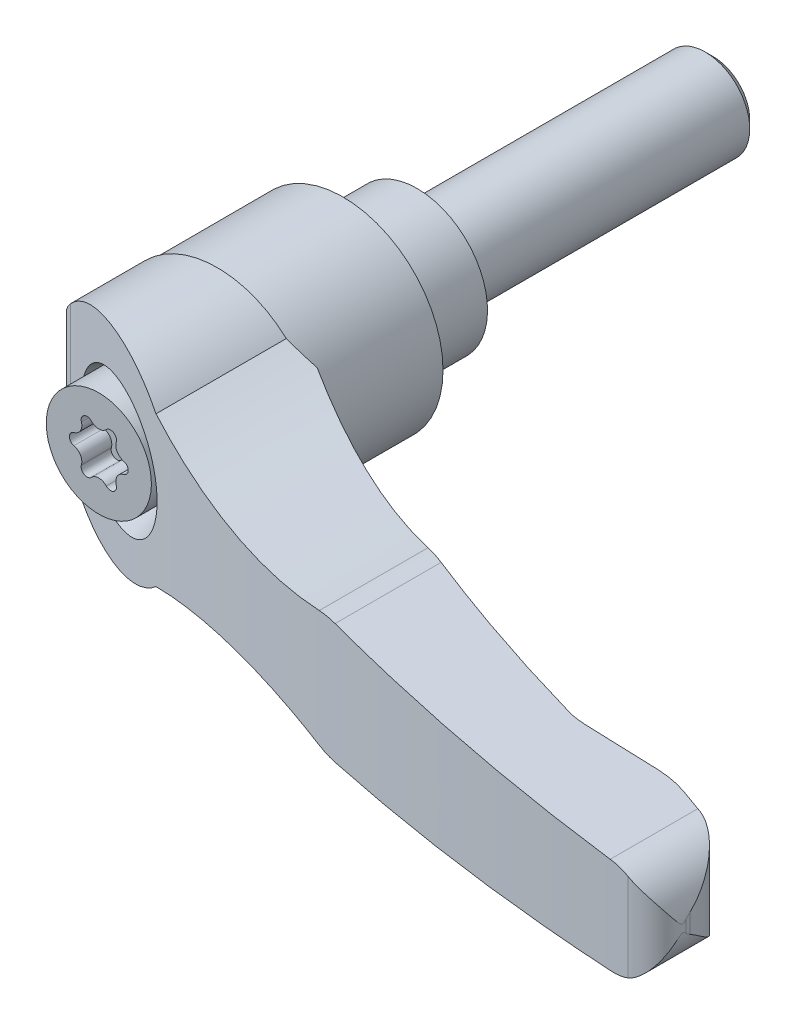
ISO-10303-21;
HEADER;
FILE_DESCRIPTION(('STEP AP214'),'2;1');
FILE_NAME('part.step','',(''),(''),'','','');
FILE_SCHEMA(('AUTOMOTIVE_DESIGN { 1 0 10303 214 1 1 1 1 }'));
ENDSEC;
DATA;
#1=APPLICATION_CONTEXT('core data for automotive mechanical design processes');
#2=APPLICATION_PROTOCOL_DEFINITION('international standard','automotive_design',2000,#1);
#3=PRODUCT_CONTEXT('',#1,'mechanical');
#4=PRODUCT('Part','Part','',(#3));
#5=PRODUCT_RELATED_PRODUCT_CATEGORY('part','',(#4));
#6=PRODUCT_DEFINITION_FORMATION('','',#4);
#7=PRODUCT_DEFINITION_CONTEXT('part definition',#1,'design');
#8=PRODUCT_DEFINITION('design','',#6,#7);
#9=PRODUCT_DEFINITION_SHAPE('','',#8);
#10=(LENGTH_UNIT() NAMED_UNIT(*) SI_UNIT(.MILLI.,.METRE.));
#11=(NAMED_UNIT(*) PLANE_ANGLE_UNIT() SI_UNIT($,.RADIAN.));
#12=(NAMED_UNIT(*) SI_UNIT($,.STERADIAN.) SOLID_ANGLE_UNIT());
#13=UNCERTAINTY_MEASURE_WITH_UNIT(LENGTH_MEASURE(1.E-05),#10,'distance_accuracy_value','');
#14=(GEOMETRIC_REPRESENTATION_CONTEXT(3) GLOBAL_UNCERTAINTY_ASSIGNED_CONTEXT((#13)) GLOBAL_UNIT_ASSIGNED_CONTEXT((#10,
#11,#12)) REPRESENTATION_CONTEXT('',''));
#15=CARTESIAN_POINT('',(0.,0.,0.));
#16=DIRECTION('',(0.,0.,1.));
#17=DIRECTION('',(1.,0.,0.));
#18=AXIS2_PLACEMENT_3D('',#15,#16,#17);
#19=CARTESIAN_POINT('',(0.,0.,-11.962456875));
#20=DIRECTION('',(0.,0.,-1.));
#21=DIRECTION('',(0.,1.,0.));
#22=AXIS2_PLACEMENT_3D('',#19,#20,#21);
#23=CYLINDRICAL_SURFACE('',#22,6.);
#24=CARTESIAN_POINT('',(0.,0.,-38.92));
#25=DIRECTION('',(0.,0.,-1.));
#26=DIRECTION('',(0.,1.,0.));
#27=AXIS2_PLACEMENT_3D('',#24,#25,#26);
#28=CIRCLE('',#27,6.);
#29=CARTESIAN_POINT('',(0.,6.,-38.92));
#30=VERTEX_POINT('',#29);
#31=EDGE_CURVE('E9',#30,#30,#28,.F.);
#32=ORIENTED_EDGE('',*,*,#31,.T.);
#33=EDGE_LOOP('',(#32));
#34=FACE_BOUND('',#33,.T.);
#35=CARTESIAN_POINT('',(0.,0.,0.));
#36=DIRECTION('',(0.,0.,-1.));
#37=DIRECTION('',(0.,1.,0.));
#38=AXIS2_PLACEMENT_3D('',#35,#36,#37);
#39=CIRCLE('',#38,6.);
#40=CARTESIAN_POINT('',(0.,6.,0.));
#41=VERTEX_POINT('',#40);
#42=EDGE_CURVE('E243',#41,#41,#39,.F.);
#43=ORIENTED_EDGE('',*,*,#42,.F.);
#44=EDGE_LOOP('',(#43));
#45=FACE_BOUND('',#44,.T.);
#46=ADVANCED_FACE('F14',(#34,#45),#23,.T.);
#47=CARTESIAN_POINT('',(7.75,0.,0.));
#48=DIRECTION('',(0.,0.,-1.));
#49=DIRECTION('',(0.,1.,0.));
#50=AXIS2_PLACEMENT_3D('',#47,#48,#49);
#51=PLANE('',#50);
#52=ORIENTED_EDGE('',*,*,#42,.T.);
#53=EDGE_LOOP('',(#52));
#54=FACE_BOUND('',#53,.T.);
#55=CARTESIAN_POINT('',(0.,0.,0.));
#56=DIRECTION('',(0.,0.,-1.));
#57=DIRECTION('',(0.,1.,0.));
#58=AXIS2_PLACEMENT_3D('',#55,#56,#57);
#59=CIRCLE('',#58,9.5);
#60=CARTESIAN_POINT('',(0.,9.5,0.));
#61=VERTEX_POINT('',#60);
#62=EDGE_CURVE('E784',#61,#61,#59,.F.);
#63=ORIENTED_EDGE('',*,*,#62,.F.);
#64=EDGE_LOOP('',(#63));
#65=FACE_BOUND('',#64,.T.);
#66=ADVANCED_FACE('F822',(#54,#65),#51,.T.);
#67=CARTESIAN_POINT('',(0.,0.,12.4));
#68=DIRECTION('',(0.,0.,-1.));
#69=DIRECTION('',(0.,1.,0.));
#70=AXIS2_PLACEMENT_3D('',#67,#68,#69);
#71=CYLINDRICAL_SURFACE('',#70,9.5);
#72=ORIENTED_EDGE('',*,*,#62,.T.);
#73=EDGE_LOOP('',(#72));
#74=FACE_BOUND('',#73,.T.);
#75=CARTESIAN_POINT('',(0.,0.,10.7));
#76=DIRECTION('',(0.,0.,-1.));
#77=DIRECTION('',(1.,0.,0.));
#78=AXIS2_PLACEMENT_3D('',#75,#76,#77);
#79=CIRCLE('',#78,9.5);
#80=CARTESIAN_POINT('',(9.5,0.,10.7));
#81=VERTEX_POINT('',#80);
#82=EDGE_CURVE('E326',#81,#81,#79,.T.);
#83=ORIENTED_EDGE('',*,*,#82,.T.);
#84=EDGE_LOOP('',(#83));
#85=FACE_BOUND('',#84,.T.);
#86=ADVANCED_FACE('F584',(#74,#85),#71,.T.);
#87=CARTESIAN_POINT('',(0.,0.,10.4));
#88=DIRECTION('',(0.,0.,-1.));
#89=DIRECTION('',(0.,1.,0.));
#90=AXIS2_PLACEMENT_3D('',#87,#88,#89);
#91=CONICAL_SURFACE('',#90,9.8,0.785398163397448);
#92=ORIENTED_EDGE('',*,*,#82,.F.);
#93=EDGE_LOOP('',(#92));
#94=FACE_BOUND('',#93,.T.);
#95=CARTESIAN_POINT('',(0.,0.,10.4));
#96=DIRECTION('',(0.,0.,-1.));
#97=DIRECTION('',(0.,1.,0.));
#98=AXIS2_PLACEMENT_3D('',#95,#96,#97);
#99=CIRCLE('',#98,9.8);
#100=CARTESIAN_POINT('',(0.,9.8,10.4));
#101=VERTEX_POINT('',#100);
#102=EDGE_CURVE('E322',#101,#101,#99,.T.);
#103=ORIENTED_EDGE('',*,*,#102,.T.);
#104=EDGE_LOOP('',(#103));
#105=FACE_BOUND('',#104,.T.);
#106=ADVANCED_FACE('F585',(#94,#105),#91,.F.);
#107=CARTESIAN_POINT('',(0.,0.,9.7));
#108=DIRECTION('',(0.,0.,-1.));
#109=DIRECTION('',(0.,1.,0.));
#110=AXIS2_PLACEMENT_3D('',#107,#108,#109);
#111=CYLINDRICAL_SURFACE('',#110,9.8);
#112=ORIENTED_EDGE('',*,*,#102,.F.);
#113=EDGE_LOOP('',(#112));
#114=FACE_BOUND('',#113,.T.);
#115=CARTESIAN_POINT('',(0.,0.,10.));
#116=DIRECTION('',(0.,0.,-1.));
#117=DIRECTION('',(0.,1.,0.));
#118=AXIS2_PLACEMENT_3D('',#115,#116,#117);
#119=CIRCLE('',#118,9.8);
#120=CARTESIAN_POINT('',(0.,9.8,10.));
#121=VERTEX_POINT('',#120);
#122=EDGE_CURVE('E325',#121,#121,#119,.F.);
#123=ORIENTED_EDGE('',*,*,#122,.F.);
#124=EDGE_LOOP('',(#123));
#125=FACE_BOUND('',#124,.T.);
#126=ADVANCED_FACE('F588',(#114,#125),#111,.F.);
#127=CARTESIAN_POINT('',(-13.2600377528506,-27.5,10.));
#128=DIRECTION('',(0.707106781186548,0.,0.707106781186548));
#129=DIRECTION('',(-0.707106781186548,0.,0.707106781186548));
#130=AXIS2_PLACEMENT_3D('',#127,#128,#129);
#131=PLANE('',#130);
#132=DIRECTION('',(0.,1.,0.));
#133=VECTOR('',#132,1.);
#134=CARTESIAN_POINT('',(-13.2600377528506,0.,10.));
#135=LINE('',#134,#133);
#136=CARTESIAN_POINT('',(-13.2600377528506,-2.58582666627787,10.));
#137=VERTEX_POINT('',#136);
#138=CARTESIAN_POINT('',(-13.2600377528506,2.58582666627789,10.));
#139=VERTEX_POINT('',#138);
#140=EDGE_CURVE('E770',#137,#139,#135,.T.);
#141=ORIENTED_EDGE('',*,*,#140,.F.);
#142=CARTESIAN_POINT('',(-0.00999999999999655,0.,-3.25003775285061));
#143=DIRECTION('',(0.707106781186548,0.,0.707106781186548));
#144=DIRECTION('',(-0.707106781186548,0.,0.707106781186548));
#145=AXIS2_PLACEMENT_3D('',#142,#143,#144);
#146=ELLIPSE('',#145,19.0918830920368,13.5);
#147=EDGE_CURVE('E772',#139,#137,#146,.T.);
#148=ORIENTED_EDGE('',*,*,#147,.F.);
#149=EDGE_LOOP('',(#141,#148));
#150=FACE_BOUND('',#149,.T.);
#151=ADVANCED_FACE('F592',(#150),#131,.F.);
#152=CARTESIAN_POINT('',(-6.76,0.,10.));
#153=DIRECTION('',(0.,0.,-1.));
#154=DIRECTION('',(0.,1.,0.));
#155=AXIS2_PLACEMENT_3D('',#152,#153,#154);
#156=PLANE('',#155);
#157=ORIENTED_EDGE('',*,*,#140,.T.);
#158=CARTESIAN_POINT('',(-0.00999999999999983,0.,10.));
#159=DIRECTION('',(0.,0.,1.));
#160=DIRECTION('',(-1.,0.,0.));
#161=AXIS2_PLACEMENT_3D('',#158,#159,#160);
#162=CIRCLE('',#161,13.5);
#163=EDGE_CURVE('E775',#137,#139,#162,.T.);
#164=ORIENTED_EDGE('',*,*,#163,.F.);
#165=EDGE_LOOP('',(#157,#164));
#166=FACE_BOUND('',#165,.T.);
#167=ORIENTED_EDGE('',*,*,#122,.T.);
#168=EDGE_LOOP('',(#167));
#169=FACE_BOUND('',#168,.T.);
#170=ADVANCED_FACE('F596',(#166,#169),#156,.T.);
#171=CARTESIAN_POINT('',(-0.0100000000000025,0.,20.75));
#172=DIRECTION('',(0.,0.,1.));
#173=DIRECTION('',(-1.,0.,0.));
#174=AXIS2_PLACEMENT_3D('',#171,#172,#173);
#175=CYLINDRICAL_SURFACE('',#174,13.5);
#176=ORIENTED_EDGE('',*,*,#163,.T.);
#177=ORIENTED_EDGE('',*,*,#147,.T.);
#178=EDGE_LOOP('',(#176,#177));
#179=FACE_BOUND('',#178,.T.);
#180=CARTESIAN_POINT('',(-0.010000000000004,0.,27.));
#181=DIRECTION('',(0.,0.,1.));
#182=DIRECTION('',(-1.,0.,0.));
#183=AXIS2_PLACEMENT_3D('',#180,#181,#182);
#184=CIRCLE('',#183,13.5);
#185=CARTESIAN_POINT('',(-13.51,0.,27.));
#186=VERTEX_POINT('',#185);
#187=CARTESIAN_POINT('',(13.4899999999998,0.,27.));
#188=VERTEX_POINT('',#187);
#189=EDGE_CURVE('E311',#186,#188,#184,.T.);
#190=ORIENTED_EDGE('',*,*,#189,.F.);
#191=CARTESIAN_POINT('',(-0.010000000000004,0.,27.));
#192=DIRECTION('',(0.,0.,1.));
#193=DIRECTION('',(-1.,0.,0.));
#194=AXIS2_PLACEMENT_3D('',#191,#192,#193);
#195=CIRCLE('',#194,13.5);
#196=EDGE_CURVE('E316',#188,#186,#195,.T.);
#197=ORIENTED_EDGE('',*,*,#196,.F.);
#198=EDGE_LOOP('',(#190,#197));
#199=FACE_BOUND('',#198,.T.);
#200=ADVANCED_FACE('F600',(#179,#199),#175,.T.);
#201=CARTESIAN_POINT('',(94.8688366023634,-14.75,58.0130023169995));
#202=DIRECTION('',(0.992331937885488,0.,-0.123601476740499));
#203=DIRECTION('',(0.123601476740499,0.,0.992331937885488));
#204=AXIS2_PLACEMENT_3D('',#201,#202,#203);
#205=PLANE('',#204);
#206=CARTESIAN_POINT('',(88.5,0.,6.88092740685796));
#207=DIRECTION('',(0.992331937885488,0.,-0.123601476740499));
#208=DIRECTION('',(0.123601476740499,0.,0.992331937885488));
#209=AXIS2_PLACEMENT_3D('',#206,#207,#208);
#210=ELLIPSE('',#209,52.588368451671,6.5);
#211=CARTESIAN_POINT('',(94.9511621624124,-0.795302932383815,58.6739513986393));
#212=VERTEX_POINT('',#211);
#213=CARTESIAN_POINT('',(94.8688366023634,-1.29919988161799,58.0130023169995));
#214=VERTEX_POINT('',#213);
#215=EDGE_CURVE('E768',#212,#214,#210,.T.);
#216=ORIENTED_EDGE('',*,*,#215,.T.);
#217=DIRECTION('',(0.,-1.,0.));
#218=VECTOR('',#217,1.);
#219=CARTESIAN_POINT('',(94.8688366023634,-14.75,58.0130023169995));
#220=LINE('',#219,#218);
#221=CARTESIAN_POINT('',(94.8688366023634,1.29919988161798,58.0130023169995));
#222=VERTEX_POINT('',#221);
#223=EDGE_CURVE('E303',#222,#214,#220,.T.);
#224=ORIENTED_EDGE('',*,*,#223,.F.);
#225=CARTESIAN_POINT('',(88.5,0.,6.88092740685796));
#226=DIRECTION('',(0.992331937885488,0.,-0.123601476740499));
#227=DIRECTION('',(0.123601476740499,0.,0.992331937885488));
#228=AXIS2_PLACEMENT_3D('',#225,#226,#227);
#229=ELLIPSE('',#228,52.588368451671,6.5);
#230=CARTESIAN_POINT('',(94.9511621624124,0.795302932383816,58.6739513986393));
#231=VERTEX_POINT('',#230);
#232=EDGE_CURVE('E769',#222,#231,#229,.T.);
#233=ORIENTED_EDGE('',*,*,#232,.T.);
#234=DIRECTION('',(0.,-1.,0.));
#235=VECTOR('',#234,1.);
#236=CARTESIAN_POINT('',(94.9511621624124,-14.75,58.6739513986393));
#237=LINE('',#236,#235);
#238=EDGE_CURVE('E765',#231,#212,#237,.T.);
#239=ORIENTED_EDGE('',*,*,#238,.T.);
#240=EDGE_LOOP('',(#216,#224,#233,#239));
#241=FACE_BOUND('',#240,.T.);
#242=ADVANCED_FACE('F604',(#241),#205,.T.);
#243=CARTESIAN_POINT('',(-13.51,-14.75,27.));
#244=DIRECTION('',(0.,0.,-1.));
#245=DIRECTION('',(0.,1.,0.));
#246=AXIS2_PLACEMENT_3D('',#243,#244,#245);
#247=PLANE('',#246);
#248=DIRECTION('',(0.,-1.,0.));
#249=VECTOR('',#248,1.);
#250=CARTESIAN_POINT('',(-13.51,-14.75,27.));
#251=LINE('',#250,#249);
#252=CARTESIAN_POINT('',(-13.51,2.55781156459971,27.));
#253=VERTEX_POINT('',#252);
#254=EDGE_CURVE('E312',#253,#186,#251,.T.);
#255=ORIENTED_EDGE('',*,*,#254,.F.);
#256=CARTESIAN_POINT('',(0.,0.,27.));
#257=DIRECTION('',(0.,0.,1.));
#258=DIRECTION('',(0.,-1.,0.));
#259=AXIS2_PLACEMENT_3D('',#256,#257,#258);
#260=CIRCLE('',#259,13.75);
#261=CARTESIAN_POINT('',(9.32365402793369,10.1060365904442,27.));
#262=VERTEX_POINT('',#261);
#263=EDGE_CURVE('E488',#262,#253,#260,.T.);
#264=ORIENTED_EDGE('',*,*,#263,.F.);
#265=CARTESIAN_POINT('',(29.15,64.91,27.));
#266=DIRECTION('',(0.,0.,1.));
#267=DIRECTION('',(0.,-1.,0.));
#268=AXIS2_PLACEMENT_3D('',#265,#266,#267);
#269=CIRCLE('',#268,58.28);
#270=CARTESIAN_POINT('',(13.4899999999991,8.77335599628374,27.));
#271=VERTEX_POINT('',#270);
#272=EDGE_CURVE('E450',#262,#271,#269,.T.);
#273=ORIENTED_EDGE('',*,*,#272,.T.);
#274=DIRECTION('',(0.,-1.,0.));
#275=VECTOR('',#274,1.);
#276=CARTESIAN_POINT('',(13.4899999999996,-14.75,27.0000000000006));
#277=LINE('',#276,#275);
#278=EDGE_CURVE('E307',#271,#188,#277,.T.);
#279=ORIENTED_EDGE('',*,*,#278,.T.);
#280=ORIENTED_EDGE('',*,*,#196,.T.);
#281=EDGE_LOOP('',(#255,#264,#273,#279,#280));
#282=FACE_BOUND('',#281,.T.);
#283=ADVANCED_FACE('F608',(#282),#247,.T.);
#284=CARTESIAN_POINT('',(-13.51,-14.75,31.4135672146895));
#285=DIRECTION('',(-1.,0.,0.));
#286=DIRECTION('',(0.,-1.,0.));
#287=AXIS2_PLACEMENT_3D('',#284,#285,#286);
#288=PLANE('',#287);
#289=DIRECTION('',(0.,0.,1.));
#290=VECTOR('',#289,1.);
#291=CARTESIAN_POINT('',(-13.51,-2.5578115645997,63.));
#292=LINE('',#291,#290);
#293=CARTESIAN_POINT('',(-13.51,-2.55781156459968,31.4135672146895));
#294=VERTEX_POINT('',#293);
#295=CARTESIAN_POINT('',(-13.51,-2.55781156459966,27.));
#296=VERTEX_POINT('',#295);
#297=EDGE_CURVE('E315',#294,#296,#292,.F.);
#298=ORIENTED_EDGE('',*,*,#297,.F.);
#299=DIRECTION('',(0.,-1.,0.));
#300=VECTOR('',#299,1.);
#301=CARTESIAN_POINT('',(-13.51,-14.75,31.4135672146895));
#302=LINE('',#301,#300);
#303=CARTESIAN_POINT('',(-13.51,2.55781156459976,31.4135672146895));
#304=VERTEX_POINT('',#303);
#305=EDGE_CURVE('E502',#304,#294,#302,.T.);
#306=ORIENTED_EDGE('',*,*,#305,.F.);
#307=DIRECTION('',(0.,0.,1.));
#308=VECTOR('',#307,1.);
#309=CARTESIAN_POINT('',(-13.51,2.55781156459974,63.));
#310=LINE('',#309,#308);
#311=EDGE_CURVE('E491',#253,#304,#310,.T.);
#312=ORIENTED_EDGE('',*,*,#311,.F.);
#313=ORIENTED_EDGE('',*,*,#254,.T.);
#314=DIRECTION('',(0.,1.,0.));
#315=VECTOR('',#314,1.);
#316=CARTESIAN_POINT('',(-13.51,-14.75,27.));
#317=LINE('',#316,#315);
#318=EDGE_CURVE('E750',#296,#186,#317,.T.);
#319=ORIENTED_EDGE('',*,*,#318,.F.);
#320=EDGE_LOOP('',(#298,#306,#312,#313,#319));
#321=FACE_BOUND('',#320,.T.);
#322=ADVANCED_FACE('F612',(#321),#288,.T.);
#323=CARTESIAN_POINT('',(-13.51,-14.75,27.));
#324=DIRECTION('',(0.,0.,-1.));
#325=DIRECTION('',(0.,1.,0.));
#326=AXIS2_PLACEMENT_3D('',#323,#324,#325);
#327=PLANE('',#326);
#328=ORIENTED_EDGE('',*,*,#189,.T.);
#329=DIRECTION('',(0.,-1.,0.));
#330=VECTOR('',#329,1.);
#331=CARTESIAN_POINT('',(13.4899999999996,-14.75,27.0000000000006));
#332=LINE('',#331,#330);
#333=CARTESIAN_POINT('',(13.4899999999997,-8.77335599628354,27.));
#334=VERTEX_POINT('',#333);
#335=EDGE_CURVE('E741',#188,#334,#332,.T.);
#336=ORIENTED_EDGE('',*,*,#335,.T.);
#337=CARTESIAN_POINT('',(29.15,-64.91,27.));
#338=DIRECTION('',(0.,0.,1.));
#339=DIRECTION('',(0.,-1.,0.));
#340=AXIS2_PLACEMENT_3D('',#337,#338,#339);
#341=CIRCLE('',#340,58.28);
#342=CARTESIAN_POINT('',(9.32365402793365,-10.1060365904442,27.));
#343=VERTEX_POINT('',#342);
#344=EDGE_CURVE('E737',#334,#343,#341,.T.);
#345=ORIENTED_EDGE('',*,*,#344,.T.);
#346=CARTESIAN_POINT('',(0.,0.,27.));
#347=DIRECTION('',(0.,0.,1.));
#348=DIRECTION('',(0.,-1.,0.));
#349=AXIS2_PLACEMENT_3D('',#346,#347,#348);
#350=CIRCLE('',#349,13.75);
#351=EDGE_CURVE('E736',#296,#343,#350,.T.);
#352=ORIENTED_EDGE('',*,*,#351,.F.);
#353=ORIENTED_EDGE('',*,*,#318,.T.);
#354=EDGE_LOOP('',(#328,#336,#345,#352,#353));
#355=FACE_BOUND('',#354,.T.);
#356=ADVANCED_FACE('F616',(#355),#327,.T.);
#357=CARTESIAN_POINT('',(81.4673032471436,-14.75,62.36));
#358=DIRECTION('',(0.,-1.,0.));
#359=DIRECTION('',(1.,0.,0.));
#360=AXIS2_PLACEMENT_3D('',#357,#358,#359);
#361=CYLINDRICAL_SURFACE('',#360,13.39);
#362=CARTESIAN_POINT('',(81.4673032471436,-6.75541913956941,62.36));
#363=DIRECTION('',(-0.0362948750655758,0.999341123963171,0.));
#364=DIRECTION('',(-0.999341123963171,-0.0362948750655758,0.));
#365=AXIS2_PLACEMENT_3D('',#362,#363,#364);
#366=ELLIPSE('',#365,13.3988281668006,13.39);
#367=CARTESIAN_POINT('',(85.7182287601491,-6.60103060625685,49.6626879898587));
#368=VERTEX_POINT('',#367);
#369=CARTESIAN_POINT('',(81.4673032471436,-6.75541913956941,48.97));
#370=VERTEX_POINT('',#369);
#371=EDGE_CURVE('E640',#368,#370,#366,.T.);
#372=ORIENTED_EDGE('',*,*,#371,.T.);
#373=DIRECTION('',(0.,1.,0.));
#374=VECTOR('',#373,1.);
#375=CARTESIAN_POINT('',(81.4673032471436,-14.75,48.97));
#376=LINE('',#375,#374);
#377=CARTESIAN_POINT('',(81.4673032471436,6.75541913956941,48.97));
#378=VERTEX_POINT('',#377);
#379=EDGE_CURVE('E308',#378,#370,#376,.F.);
#380=ORIENTED_EDGE('',*,*,#379,.F.);
#381=CARTESIAN_POINT('',(81.4673032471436,6.75541913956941,62.36));
#382=DIRECTION('',(-0.0362948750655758,-0.999341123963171,0.));
#383=DIRECTION('',(0.999341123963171,-0.0362948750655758,0.));
#384=AXIS2_PLACEMENT_3D('',#381,#382,#383);
#385=ELLIPSE('',#384,13.3988281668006,13.39);
#386=CARTESIAN_POINT('',(85.7182287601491,6.60103060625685,49.6626879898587));
#387=VERTEX_POINT('',#386);
#388=EDGE_CURVE('E452',#378,#387,#385,.T.);
#389=ORIENTED_EDGE('',*,*,#388,.T.);
#390=DIRECTION('',(0.,-1.,0.));
#391=VECTOR('',#390,1.);
#392=CARTESIAN_POINT('',(85.7182287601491,-14.75,49.6626879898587));
#393=LINE('',#392,#391);
#394=EDGE_CURVE('E300',#368,#387,#393,.F.);
#395=ORIENTED_EDGE('',*,*,#394,.F.);
#396=EDGE_LOOP('',(#372,#380,#389,#395));
#397=FACE_BOUND('',#396,.T.);
#398=ADVANCED_FACE('F620',(#397),#361,.T.);
#399=CARTESIAN_POINT('',(71.6523269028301,-14.75,48.97));
#400=DIRECTION('',(0.,0.,-1.));
#401=DIRECTION('',(0.,1.,0.));
#402=AXIS2_PLACEMENT_3D('',#399,#400,#401);
#403=PLANE('',#402);
#404=DIRECTION('',(-0.999341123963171,-0.0362948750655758,0.));
#405=VECTOR('',#404,1.);
#406=CARTESIAN_POINT('',(88.5,-6.5,48.97));
#407=LINE('',#406,#405);
#408=CARTESIAN_POINT('',(71.6523269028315,-7.11188734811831,48.97));
#409=VERTEX_POINT('',#408);
#410=EDGE_CURVE('E632',#370,#409,#407,.T.);
#411=ORIENTED_EDGE('',*,*,#410,.T.);
#412=DIRECTION('',(0.,-1.,0.));
#413=VECTOR('',#412,1.);
#414=CARTESIAN_POINT('',(71.6523269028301,-14.75,48.97));
#415=LINE('',#414,#413);
#416=CARTESIAN_POINT('',(71.6523269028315,7.11188734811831,48.97));
#417=VERTEX_POINT('',#416);
#418=EDGE_CURVE('E305',#409,#417,#415,.F.);
#419=ORIENTED_EDGE('',*,*,#418,.T.);
#420=DIRECTION('',(0.999341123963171,-0.0362948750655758,0.));
#421=VECTOR('',#420,1.);
#422=CARTESIAN_POINT('',(43.9670619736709,8.1173830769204,48.97));
#423=LINE('',#422,#421);
#424=EDGE_CURVE('E760',#417,#378,#423,.T.);
#425=ORIENTED_EDGE('',*,*,#424,.T.);
#426=ORIENTED_EDGE('',*,*,#379,.T.);
#427=EDGE_LOOP('',(#411,#419,#425,#426));
#428=FACE_BOUND('',#427,.T.);
#429=ADVANCED_FACE('F623',(#428),#403,.T.);
#430=CARTESIAN_POINT('',(71.6523269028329,-14.75,38.8899999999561));
#431=DIRECTION('',(0.,-1.,0.));
#432=DIRECTION('',(1.,0.,0.));
#433=AXIS2_PLACEMENT_3D('',#430,#431,#432);
#434=CYLINDRICAL_SURFACE('',#433,10.0800000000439);
#435=ORIENTED_EDGE('',*,*,#418,.F.);
#436=CARTESIAN_POINT('',(71.6523269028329,-7.11188734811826,38.8899999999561));
#437=DIRECTION('',(-0.0362948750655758,0.999341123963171,0.));
#438=DIRECTION('',(-0.999341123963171,-0.0362948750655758,0.));
#439=AXIS2_PLACEMENT_3D('',#436,#437,#438);
#440=ELLIPSE('',#439,10.086645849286,10.0800000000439);
#441=CARTESIAN_POINT('',(69.1344137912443,-7.20333494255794,48.6504566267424));
#442=VERTEX_POINT('',#441);
#443=EDGE_CURVE('E639',#409,#442,#440,.F.);
#444=ORIENTED_EDGE('',*,*,#443,.T.);
#445=DIRECTION('',(0.,-1.,0.));
#446=VECTOR('',#445,1.);
#447=CARTESIAN_POINT('',(69.1344156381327,-14.75,48.6504571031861));
#448=LINE('',#447,#446);
#449=CARTESIAN_POINT('',(69.1344137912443,7.20333494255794,48.6504566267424));
#450=VERTEX_POINT('',#449);
#451=EDGE_CURVE('E744',#442,#450,#448,.F.);
#452=ORIENTED_EDGE('',*,*,#451,.T.);
#453=CARTESIAN_POINT('',(71.6523269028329,7.11188734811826,38.8899999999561));
#454=DIRECTION('',(-0.0362948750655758,-0.999341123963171,0.));
#455=DIRECTION('',(0.999341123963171,-0.0362948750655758,0.));
#456=AXIS2_PLACEMENT_3D('',#453,#454,#455);
#457=ELLIPSE('',#456,10.086645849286,10.0800000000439);
#458=EDGE_CURVE('E643',#450,#417,#457,.F.);
#459=ORIENTED_EDGE('',*,*,#458,.T.);
#460=EDGE_LOOP('',(#435,#444,#452,#459));
#461=FACE_BOUND('',#460,.T.);
#462=ADVANCED_FACE('F460',(#461),#434,.F.);
#463=CARTESIAN_POINT('',(132.162219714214,-14.75,-195.670803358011));
#464=DIRECTION('',(0.,-1.,0.));
#465=DIRECTION('',(1.,0.,0.));
#466=AXIS2_PLACEMENT_3D('',#463,#464,#465);
#467=CYLINDRICAL_SURFACE('',#466,252.32);
#468=CARTESIAN_POINT('',(43.9670619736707,8.11738307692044,40.7335040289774));
#469=CARTESIAN_POINT('',(43.7285909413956,8.12604852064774,40.6445396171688));
#470=CARTESIAN_POINT('',(43.4900264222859,8.12742192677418,40.5551257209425));
#471=CARTESIAN_POINT('',(43.014251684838,8.11567103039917,40.375985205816));
#472=CARTESIAN_POINT('',(42.7770395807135,8.10259351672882,40.2862605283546));
#473=CARTESIAN_POINT('',(42.3039618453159,8.06208212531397,40.1065066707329));
#474=CARTESIAN_POINT('',(42.0680962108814,8.03464828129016,40.0164774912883));
#475=CARTESIAN_POINT('',(41.5977019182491,7.96541677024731,39.8361272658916));
#476=CARTESIAN_POINT('',(41.3631800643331,7.92357286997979,39.7458062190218));
#477=CARTESIAN_POINT('',(41.1300932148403,7.87460952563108,39.6556387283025));
#478=B_SPLINE_CURVE_WITH_KNOTS('',3,(#468,#469,#470,#471,#472,#473,#474,#475,#476,#477),
.UNSPECIFIED.,.F.,.F.,(4,2,2,2,4),(0.,0.763908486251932,1.52535083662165,2.28679139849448,
3.05069808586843),.UNSPECIFIED.);
#479=CARTESIAN_POINT('',(43.9670619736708,8.11738307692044,40.7335040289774));
#480=VERTEX_POINT('',#479);
#481=CARTESIAN_POINT('',(41.1300932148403,7.87460952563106,39.6556387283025));
#482=VERTEX_POINT('',#481);
#483=EDGE_CURVE('E440',#480,#482,#478,.T.);
#484=ORIENTED_EDGE('',*,*,#483,.F.);
#485=CARTESIAN_POINT('',(132.162219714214,4.9142403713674,-195.670803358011));
#486=DIRECTION('',(-0.0362948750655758,-0.999341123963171,0.));
#487=DIRECTION('',(0.999341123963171,-0.0362948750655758,0.));
#488=AXIS2_PLACEMENT_3D('',#485,#486,#487);
#489=ELLIPSE('',#488,252.486357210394,252.32);
#490=EDGE_CURVE('E715',#480,#450,#489,.F.);
#491=ORIENTED_EDGE('',*,*,#490,.T.);
#492=ORIENTED_EDGE('',*,*,#451,.F.);
#493=CARTESIAN_POINT('',(132.162219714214,-4.91424037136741,-195.670803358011));
#494=DIRECTION('',(-0.0362948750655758,0.999341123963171,0.));
#495=DIRECTION('',(-0.999341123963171,-0.0362948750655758,0.));
#496=AXIS2_PLACEMENT_3D('',#493,#494,#495);
#497=ELLIPSE('',#496,252.486357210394,252.32);
#498=CARTESIAN_POINT('',(43.9670619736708,-8.11738307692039,40.7335040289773));
#499=VERTEX_POINT('',#498);
#500=EDGE_CURVE('E647',#442,#499,#497,.F.);
#501=ORIENTED_EDGE('',*,*,#500,.T.);
#502=CARTESIAN_POINT('',(41.1300929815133,-7.87460947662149,39.6556386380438));
#503=CARTESIAN_POINT('',(41.3631798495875,-7.92357282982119,39.7458061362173));
#504=CARTESIAN_POINT('',(41.5977017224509,-7.96541673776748,39.8361271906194));
#505=CARTESIAN_POINT('',(42.0680960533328,-8.03464826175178,40.0164774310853));
#506=CARTESIAN_POINT('',(42.3039617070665,-8.06208211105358,40.1065066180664));
#507=CARTESIAN_POINT('',(42.7770394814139,-8.10259351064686,40.2862604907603));
#508=CARTESIAN_POINT('',(43.0142516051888,-8.11567102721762,40.3759851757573));
#509=CARTESIAN_POINT('',(43.4900263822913,-8.12742192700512,40.5551257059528));
#510=CARTESIAN_POINT('',(43.7285909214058,-8.12604852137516,40.6445396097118));
#511=CARTESIAN_POINT('',(43.9670619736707,-8.11738307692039,40.7335040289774));
#512=B_SPLINE_CURVE_WITH_KNOTS('',3,(#502,#503,#504,#505,#506,#507,#508,#509,#510,#511),
.UNSPECIFIED.,.F.,.F.,(4,2,2,2,4),(0.,0.763906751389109,1.52534737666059,2.28678979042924,
3.05069834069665),.UNSPECIFIED.);
#513=CARTESIAN_POINT('',(41.1300929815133,-7.8746094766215,39.6556386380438));
#514=VERTEX_POINT('',#513);
#515=EDGE_CURVE('E475',#514,#499,#512,.T.);
#516=ORIENTED_EDGE('',*,*,#515,.F.);
#517=CARTESIAN_POINT('',(41.1300929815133,-7.87460947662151,39.6556386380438));
#518=CARTESIAN_POINT('',(40.2468666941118,-7.68907790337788,39.3139933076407));
#519=CARTESIAN_POINT('',(39.3617638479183,-7.52459842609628,38.9658739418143));
#520=CARTESIAN_POINT('',(37.5897998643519,-7.23736069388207,38.2572801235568));
#521=CARTESIAN_POINT('',(36.7029388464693,-7.11459969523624,37.8968064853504));
#522=CARTESIAN_POINT('',(34.9294341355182,-6.91040287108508,37.1640922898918));
#523=CARTESIAN_POINT('',(34.0427904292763,-6.8289625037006,36.7918530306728));
#524=CARTESIAN_POINT('',(32.2715033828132,-6.70688253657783,36.0362417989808));
#525=CARTESIAN_POINT('',(31.3868600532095,-6.66624315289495,35.652869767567));
#526=CARTESIAN_POINT('',(28.7704435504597,-6.60545291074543,34.5011035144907));
#527=CARTESIAN_POINT('',(27.0436661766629,-6.64276527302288,33.7176215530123));
#528=CARTESIAN_POINT('',(23.6170342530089,-6.86784257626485,32.1161606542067));
#529=CARTESIAN_POINT('',(21.9171693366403,-7.05554807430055,31.2981954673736));
#530=CARTESIAN_POINT('',(19.6661800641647,-7.4039275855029,30.1840812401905));
#531=CARTESIAN_POINT('',(19.0983988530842,-7.50046620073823,29.9003744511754));
#532=CARTESIAN_POINT('',(17.9675115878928,-7.70999213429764,29.3299782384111));
#533=CARTESIAN_POINT('',(17.4044045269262,-7.82297580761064,29.043289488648));
#534=CARTESIAN_POINT('',(16.2796310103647,-8.06595772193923,28.4653390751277));
#535=CARTESIAN_POINT('',(15.7179955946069,-8.19605796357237,28.1740600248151));
#536=CARTESIAN_POINT('',(14.5999573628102,-8.472545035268,27.5889003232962));
#537=CARTESIAN_POINT('',(14.0435556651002,-8.61893526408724,27.2950191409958));
#538=CARTESIAN_POINT('',(13.4899999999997,-8.77335599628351,27.0000000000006));
#539=B_SPLINE_CURVE_WITH_KNOTS('',3,(#517,#518,#519,#520,#521,#522,#523,#524,#525,#526,#527,
#528,#529,#530,#531,#532,#533,#534,#535,#536,#537,#538),.UNSPECIFIED.,.F.,.F.,(4,2,2,2,2,2,2,2,
2,2,4),(0.,2.89469970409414,5.78920899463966,8.6834000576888,11.5776064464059,17.2602540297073,
22.940656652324,24.866551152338,26.7920194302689,28.7295308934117,30.6674473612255),.UNSPECIFIED.);
#540=EDGE_CURVE('E466',#514,#334,#539,.T.);
#541=ORIENTED_EDGE('',*,*,#540,.T.);
#542=ORIENTED_EDGE('',*,*,#335,.F.);
#543=ORIENTED_EDGE('',*,*,#278,.F.);
#544=CARTESIAN_POINT('',(13.4899999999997,8.77335599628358,27.0000000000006));
#545=CARTESIAN_POINT('',(14.31664655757,8.54275177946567,27.4405727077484));
#546=CARTESIAN_POINT('',(15.149663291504,8.33005321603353,27.8786057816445));
#547=CARTESIAN_POINT('',(16.82730612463,7.94113938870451,28.7487404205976));
#548=CARTESIAN_POINT('',(17.6719330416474,7.76492670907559,29.1808415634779));
#549=CARTESIAN_POINT('',(19.3724293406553,7.44952599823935,30.0386421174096));
#550=CARTESIAN_POINT('',(20.2283094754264,7.31037656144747,30.4643344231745));
#551=CARTESIAN_POINT('',(21.9491324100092,7.07004305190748,31.3079971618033));
#552=CARTESIAN_POINT('',(22.8140749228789,6.96885778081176,31.725967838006));
#553=CARTESIAN_POINT('',(24.5350860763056,6.80669813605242,32.5454832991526));
#554=CARTESIAN_POINT('',(25.3910090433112,6.74499321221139,32.9471893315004));
#555=CARTESIAN_POINT('',(27.1088771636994,6.65940525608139,33.7416486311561));
#556=CARTESIAN_POINT('',(27.9708222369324,6.63552172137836,34.1344020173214));
#557=CARTESIAN_POINT('',(29.6986634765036,6.62618362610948,34.9099811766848));
#558=CARTESIAN_POINT('',(30.5645565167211,6.64070263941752,35.2928135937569));
#559=CARTESIAN_POINT('',(32.2992228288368,6.70867652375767,36.0481188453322));
#560=CARTESIAN_POINT('',(33.1679956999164,6.76212618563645,36.4205930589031));
#561=CARTESIAN_POINT('',(34.6268488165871,6.88489763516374,37.0364018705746));
#562=CARTESIAN_POINT('',(35.2165959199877,6.94356774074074,37.2827020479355));
#563=CARTESIAN_POINT('',(36.396064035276,7.07916681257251,37.7700518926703));
#564=CARTESIAN_POINT('',(36.9857850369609,7.15609293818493,38.0111023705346));
#565=CARTESIAN_POINT('',(38.1685846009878,7.32890006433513,38.4893735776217));
#566=CARTESIAN_POINT('',(38.7616598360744,7.42490199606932,38.7265588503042));
#567=CARTESIAN_POINT('',(39.9468049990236,7.63566195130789,39.1953420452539));
#568=CARTESIAN_POINT('',(40.5388747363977,7.75042319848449,39.4269389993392));
#569=CARTESIAN_POINT('',(41.1300932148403,7.87460952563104,39.6556387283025));
#570=B_SPLINE_CURVE_WITH_KNOTS('',3,(#544,#545,#546,#547,#548,#549,#550,#551,#552,#553,#554,
#555,#556,#557,#558,#559,#560,#561,#562,#563,#564,#565,#566,#567,#568,#569),.UNSPECIFIED.,.F.,
.F.,(4,2,2,2,2,2,2,2,2,2,2,2,4),(0.,2.89390785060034,5.78802060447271,8.68513535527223,
11.5821586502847,14.4238937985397,17.2655911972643,20.1053336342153,22.9446961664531,
24.8698413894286,26.7946872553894,28.7321491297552,30.6699442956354),.UNSPECIFIED.);
#571=EDGE_CURVE('E481',#271,#482,#570,.T.);
#572=ORIENTED_EDGE('',*,*,#571,.T.);
#573=EDGE_LOOP('',(#484,#491,#492,#501,#516,#541,#542,#543,#572));
#574=FACE_BOUND('',#573,.T.);
#575=ADVANCED_FACE('F454',(#574),#467,.F.);
#576=CARTESIAN_POINT('',(85.7182287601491,-14.75,49.6626879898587));
#577=DIRECTION('',(0.317470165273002,0.,-0.948268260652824));
#578=DIRECTION('',(0.948268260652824,0.,0.317470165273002));
#579=AXIS2_PLACEMENT_3D('',#576,#577,#578);
#580=PLANE('',#579);
#581=DIRECTION('',(-0.947706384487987,-0.0344195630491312,-0.317282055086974));
#582=VECTOR('',#581,1.);
#583=CARTESIAN_POINT('',(88.5,-6.5,50.5939955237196));
#584=LINE('',#583,#582);
#585=CARTESIAN_POINT('',(88.5,-6.5,50.5939955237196));
#586=VERTEX_POINT('',#585);
#587=EDGE_CURVE('E661',#586,#368,#584,.T.);
#588=ORIENTED_EDGE('',*,*,#587,.T.);
#589=ORIENTED_EDGE('',*,*,#394,.T.);
#590=DIRECTION('',(0.947706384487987,-0.0344195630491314,0.317282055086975));
#591=VECTOR('',#590,1.);
#592=CARTESIAN_POINT('',(85.7182287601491,6.60103060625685,49.6626879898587));
#593=LINE('',#592,#591);
#594=CARTESIAN_POINT('',(88.5,6.5,50.5939955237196));
#595=VERTEX_POINT('',#594);
#596=EDGE_CURVE('E449',#387,#595,#593,.T.);
#597=ORIENTED_EDGE('',*,*,#596,.T.);
#598=CARTESIAN_POINT('',(88.5,0.,50.5939955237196));
#599=DIRECTION('',(0.317470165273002,0.,-0.948268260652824));
#600=DIRECTION('',(0.948268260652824,0.,0.317470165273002));
#601=AXIS2_PLACEMENT_3D('',#598,#599,#600);
#602=ELLIPSE('',#601,6.8546004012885,6.5);
#603=CARTESIAN_POINT('',(88.9098071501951,6.48706852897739,50.7311946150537));
#604=VERTEX_POINT('',#603);
#605=EDGE_CURVE('E320',#604,#595,#602,.F.);
#606=ORIENTED_EDGE('',*,*,#605,.F.);
#607=DIRECTION('',(0.,-1.,0.));
#608=VECTOR('',#607,1.);
#609=CARTESIAN_POINT('',(88.9098071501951,-14.75,50.7311946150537));
#610=LINE('',#609,#608);
#611=CARTESIAN_POINT('',(88.9098071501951,-6.4870685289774,50.7311946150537));
#612=VERTEX_POINT('',#611);
#613=EDGE_CURVE('E321',#612,#604,#610,.F.);
#614=ORIENTED_EDGE('',*,*,#613,.F.);
#615=CARTESIAN_POINT('',(88.5,0.,50.5939955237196));
#616=DIRECTION('',(0.317470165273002,0.,-0.948268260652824));
#617=DIRECTION('',(0.948268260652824,0.,0.317470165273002));
#618=AXIS2_PLACEMENT_3D('',#615,#616,#617);
#619=ELLIPSE('',#618,6.8546004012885,6.5);
#620=EDGE_CURVE('E304',#612,#586,#619,.T.);
#621=ORIENTED_EDGE('',*,*,#620,.T.);
#622=EDGE_LOOP('',(#588,#589,#597,#606,#614,#621));
#623=FACE_BOUND('',#622,.T.);
#624=ADVANCED_FACE('F459',(#623),#580,.T.);
#625=CARTESIAN_POINT('',(86.1065455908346,-14.75,59.1044033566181));
#626=DIRECTION('',(0.,-1.,0.));
#627=DIRECTION('',(1.,0.,0.));
#628=AXIS2_PLACEMENT_3D('',#625,#626,#627);
#629=CYLINDRICAL_SURFACE('',#628,8.83);
#630=CARTESIAN_POINT('',(88.9098071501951,-6.4870685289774,50.7311946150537));
#631=CARTESIAN_POINT('',(89.089769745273,-6.4757277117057,50.7913988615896));
#632=CARTESIAN_POINT('',(89.2672358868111,-6.4569733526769,50.8573067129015));
#633=CARTESIAN_POINT('',(89.6156587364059,-6.40594654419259,50.9994566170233));
#634=CARTESIAN_POINT('',(89.7866254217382,-6.37369580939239,51.0756819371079));
#635=CARTESIAN_POINT('',(90.1193873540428,-6.29733777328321,51.2367553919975));
#636=CARTESIAN_POINT('',(90.2812591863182,-6.25335658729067,51.3215061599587));
#637=CARTESIAN_POINT('',(90.5970344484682,-6.15465850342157,51.4993225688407));
#638=CARTESIAN_POINT('',(90.750933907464,-6.09993631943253,51.5923922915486));
#639=CARTESIAN_POINT('',(91.0845425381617,-5.96735555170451,51.8080731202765));
#640=CARTESIAN_POINT('',(91.2620732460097,-5.88706921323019,51.9325631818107));
#641=CARTESIAN_POINT('',(91.6037719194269,-5.71430400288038,52.1909876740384));
#642=CARTESIAN_POINT('',(91.7679381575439,-5.62182355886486,52.3249233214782));
#643=CARTESIAN_POINT('',(92.0835205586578,-5.42614069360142,52.6014136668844));
#644=CARTESIAN_POINT('',(92.2348770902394,-5.32289263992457,52.7440038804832));
#645=CARTESIAN_POINT('',(92.5241674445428,-5.10769832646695,53.036019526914));
#646=CARTESIAN_POINT('',(92.6621003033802,-4.99575144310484,53.1854454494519));
#647=CARTESIAN_POINT('',(92.9757333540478,-4.71982512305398,53.5491307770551));
#648=CARTESIAN_POINT('',(93.1453696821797,-4.552486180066,53.7660853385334));
#649=CARTESIAN_POINT('',(93.4603079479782,-4.20713466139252,54.208999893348));
#650=CARTESIAN_POINT('',(93.6056001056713,-4.02911783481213,54.4349634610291));
#651=CARTESIAN_POINT('',(93.8728003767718,-3.66523875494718,54.8943200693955));
#652=CARTESIAN_POINT('',(93.9947026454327,-3.47937455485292,55.1277149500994));
#653=CARTESIAN_POINT('',(94.2159458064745,-3.10252192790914,55.600867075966));
#654=CARTESIAN_POINT('',(94.3152909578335,-2.91153447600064,55.8406231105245));
#655=CARTESIAN_POINT('',(94.4598076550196,-2.59782196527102,56.2375651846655));
#656=CARTESIAN_POINT('',(94.5115034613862,-2.47567903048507,56.3928781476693));
#657=CARTESIAN_POINT('',(94.6062509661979,-2.23176482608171,56.7063336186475));
#658=CARTESIAN_POINT('',(94.6493059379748,-2.10999343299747,56.8644750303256));
#659=CARTESIAN_POINT('',(94.7073954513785,-1.92930841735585,57.1041561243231));
#660=CARTESIAN_POINT('',(94.7256435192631,-1.86953763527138,57.1842829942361));
#661=CARTESIAN_POINT('',(94.7600223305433,-1.75098004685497,57.3456972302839));
#662=CARTESIAN_POINT('',(94.7761533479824,-1.69219311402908,57.4269844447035));
#663=CARTESIAN_POINT('',(94.8063065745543,-1.57609424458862,57.5911123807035));
#664=CARTESIAN_POINT('',(94.8203269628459,-1.51878361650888,57.6739543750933));
#665=CARTESIAN_POINT('',(94.8462112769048,-1.4067606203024,57.8417526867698));
#666=CARTESIAN_POINT('',(94.8580742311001,-1.35204943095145,57.9267099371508));
#667=CARTESIAN_POINT('',(94.8688366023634,-1.29919988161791,58.0130023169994));
#668=B_SPLINE_CURVE_WITH_KNOTS('',3,(#630,#631,#632,#633,#634,#635,#636,#637,#638,#639,#640,
#641,#642,#643,#644,#645,#646,#647,#648,#649,#650,#651,#652,#653,#654,#655,#656,#657,#658,#659,
#660,#661,#662,#663,#664,#665,#666,#667),.UNSPECIFIED.,.F.,.F.,(4,2,2,2,2,2,2,2,2,2,2,2,2,2,2,2,
2,2,4),(0.,0.569903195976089,1.1388929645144,1.70199618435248,2.26537722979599,2.95800230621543,
3.6507167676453,4.3464963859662,5.04232592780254,6.00766077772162,6.97338251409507,
7.9393452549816,8.90512546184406,9.51766996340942,10.129981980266,10.4348045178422,
10.7395875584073,11.0446320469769,11.3498135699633),.UNSPECIFIED.);
#669=EDGE_CURVE('E362',#612,#214,#668,.T.);
#670=ORIENTED_EDGE('',*,*,#669,.F.);
#671=ORIENTED_EDGE('',*,*,#613,.T.);
#672=CARTESIAN_POINT('',(94.8688366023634,1.29919988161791,58.0130023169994));
#673=CARTESIAN_POINT('',(94.8598905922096,1.34309764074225,57.9412335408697));
#674=CARTESIAN_POINT('',(94.8501811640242,1.38833454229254,57.8704151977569));
#675=CARTESIAN_POINT('',(94.8292644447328,1.48075225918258,57.7303150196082));
#676=CARTESIAN_POINT('',(94.8180576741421,1.52793239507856,57.6610326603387));
#677=CARTESIAN_POINT('',(94.7822406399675,1.67127035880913,57.454961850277));
#678=CARTESIAN_POINT('',(94.7554216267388,1.76928633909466,57.3198547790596));
#679=CARTESIAN_POINT('',(94.6959351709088,1.96751896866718,57.0525736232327));
#680=CARTESIAN_POINT('',(94.6632668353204,2.06773595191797,56.9203999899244));
#681=CARTESIAN_POINT('',(94.5920450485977,2.26900598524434,56.6582540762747));
#682=CARTESIAN_POINT('',(94.5534905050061,2.37005918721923,56.5282822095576));
#683=CARTESIAN_POINT('',(94.4700311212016,2.57311073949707,56.2689600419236));
#684=CARTESIAN_POINT('',(94.4250680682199,2.67510870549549,56.1396281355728));
#685=CARTESIAN_POINT('',(94.3289987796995,2.87844084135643,55.8827641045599));
#686=CARTESIAN_POINT('',(94.2778928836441,2.97977504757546,55.7552318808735));
#687=CARTESIAN_POINT('',(94.1152135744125,3.28202886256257,55.3753189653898));
#688=CARTESIAN_POINT('',(93.9942476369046,3.48127599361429,55.1255256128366));
#689=CARTESIAN_POINT('',(93.7497347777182,3.8377769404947,54.6767706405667));
#690=CARTESIAN_POINT('',(93.6303226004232,3.99629089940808,54.4765458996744));
#691=CARTESIAN_POINT('',(93.3731353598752,4.30616830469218,54.0823566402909));
#692=CARTESIAN_POINT('',(93.2353595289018,4.45753145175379,53.8883923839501));
#693=CARTESIAN_POINT('',(92.9412287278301,4.75062950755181,53.5085527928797));
#694=CARTESIAN_POINT('',(92.7849276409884,4.89239054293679,53.3226560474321));
#695=CARTESIAN_POINT('',(92.4528785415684,5.16437580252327,52.9600281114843));
#696=CARTESIAN_POINT('',(92.2771380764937,5.2946044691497,52.7832934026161));
#697=CARTESIAN_POINT('',(91.9594754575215,5.50519013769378,52.4904514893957));
#698=CARTESIAN_POINT('',(91.8224409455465,5.58908954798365,52.371573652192));
#699=CARTESIAN_POINT('',(91.5383180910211,5.74849152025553,52.1403319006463));
#700=CARTESIAN_POINT('',(91.3912300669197,5.8239943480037,52.0279677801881));
#701=CARTESIAN_POINT('',(91.0875573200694,5.96510608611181,51.8110413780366));
#702=CARTESIAN_POINT('',(90.9309998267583,6.03074163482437,51.7064584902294));
#703=CARTESIAN_POINT('',(90.6084885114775,6.1509267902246,51.50588477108));
#704=CARTESIAN_POINT('',(90.4425377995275,6.2054800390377,51.4098911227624));
#705=CARTESIAN_POINT('',(90.0579091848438,6.31446049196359,51.2041166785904));
#706=CARTESIAN_POINT('',(89.8366451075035,6.36524880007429,51.0971370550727));
#707=CARTESIAN_POINT('',(89.4957087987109,6.42432621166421,50.9497771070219));
#708=CARTESIAN_POINT('',(89.3803026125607,6.44118527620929,50.9027564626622));
#709=CARTESIAN_POINT('',(89.1468962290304,6.46879782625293,50.8133959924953));
#710=CARTESIAN_POINT('',(89.0288944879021,6.47954757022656,50.7710590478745));
#711=CARTESIAN_POINT('',(88.9098071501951,6.48706852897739,50.7311946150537));
#712=B_SPLINE_CURVE_WITH_KNOTS('',3,(#672,#673,#674,#675,#676,#677,#678,#679,#680,#681,#682,
#683,#684,#685,#686,#687,#688,#689,#690,#691,#692,#693,#694,#695,#696,#697,#698,#699,#700,#701,
#702,#703,#704,#705,#706,#707,#708,#709,#710,#711),.UNSPECIFIED.,.F.,.F.,(4,2,2,2,2,2,2,2,2,2,2,
2,2,2,2,2,2,2,2,4),(0.,0.253746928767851,0.50740587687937,1.01438460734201,1.5214408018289,
2.02859121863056,2.54068295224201,3.05274639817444,4.07649386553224,4.92157638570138,
5.7666942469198,6.60941165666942,7.45180301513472,8.05095332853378,8.6500846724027,
9.24756833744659,9.84485532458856,10.5957153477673,10.9727456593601,11.3500066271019),.UNSPECIFIED.);
#713=EDGE_CURVE('E401',#222,#604,#712,.T.);
#714=ORIENTED_EDGE('',*,*,#713,.F.);
#715=ORIENTED_EDGE('',*,*,#223,.T.);
#716=EDGE_LOOP('',(#670,#671,#714,#715));
#717=FACE_BOUND('',#716,.T.);
#718=ADVANCED_FACE('F562',(#717),#629,.T.);
#719=CARTESIAN_POINT('',(0.,0.,44.7333253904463));
#720=DIRECTION('',(0.,0.,1.));
#721=DIRECTION('',(0.,-1.,0.));
#722=AXIS2_PLACEMENT_3D('',#719,#720,#721);
#723=CONICAL_SURFACE('',#722,9.56826327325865,0.296705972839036);
#724=CARTESIAN_POINT('',(0.,0.,36.66));
#725=DIRECTION('',(0.,0.,1.));
#726=DIRECTION('',(1.,0.,0.));
#727=AXIS2_PLACEMENT_3D('',#724,#725,#726);
#728=CIRCLE('',#727,7.1);
#729=CARTESIAN_POINT('',(7.1,0.,36.66));
#730=VERTEX_POINT('',#729);
#731=EDGE_CURVE('E317',#730,#730,#728,.T.);
#732=ORIENTED_EDGE('',*,*,#731,.F.);
#733=EDGE_LOOP('',(#732));
#734=FACE_BOUND('',#733,.T.);
#735=CARTESIAN_POINT('',(-7.48166784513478,0.,37.9083792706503));
#736=CARTESIAN_POINT('',(-7.48166535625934,0.246628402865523,37.9083804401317));
#737=CARTESIAN_POINT('',(-7.47087848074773,0.493334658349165,37.9130393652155));
#738=CARTESIAN_POINT('',(-7.42785528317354,0.984648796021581,37.9316130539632));
#739=CARTESIAN_POINT('',(-7.3956038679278,1.22925507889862,37.9455343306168));
#740=CARTESIAN_POINT('',(-7.30997188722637,1.71462822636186,37.9824690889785));
#741=CARTESIAN_POINT('',(-7.25654295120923,1.95538497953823,38.0055033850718));
#742=CARTESIAN_POINT('',(-7.12926161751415,2.43034765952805,38.0603190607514));
#743=CARTESIAN_POINT('',(-7.05541425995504,2.66455518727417,38.0920982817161));
#744=CARTESIAN_POINT('',(-6.89717057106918,3.09993104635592,38.1601053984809));
#745=CARTESIAN_POINT('',(-6.81474885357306,3.30195287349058,38.19549327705));
#746=CARTESIAN_POINT('',(-6.63509770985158,3.69814273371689,38.2725195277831));
#747=CARTESIAN_POINT('',(-6.53786363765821,3.89230827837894,38.3141598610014));
#748=CARTESIAN_POINT('',(-6.3295719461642,4.27142586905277,38.4032185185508));
#749=CARTESIAN_POINT('',(-6.21852783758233,4.45638667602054,38.4506311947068));
#750=CARTESIAN_POINT('',(-5.98345674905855,4.81634403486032,38.5508214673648));
#751=CARTESIAN_POINT('',(-5.85942876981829,4.99133981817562,38.6035994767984));
#752=CARTESIAN_POINT('',(-5.59174967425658,5.34043339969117,38.7172833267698));
#753=CARTESIAN_POINT('',(-5.44737529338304,5.51388076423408,38.7784839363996));
#754=CARTESIAN_POINT('',(-5.14632648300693,5.84780614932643,38.9058115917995));
#755=CARTESIAN_POINT('',(-4.98965140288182,6.00828348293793,38.9719388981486));
#756=CARTESIAN_POINT('',(-4.6651389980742,6.31558187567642,39.1085734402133));
#757=CARTESIAN_POINT('',(-4.4972988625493,6.46239947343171,39.1790817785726));
#758=CARTESIAN_POINT('',(-4.15160560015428,6.74177588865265,39.3239318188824));
#759=CARTESIAN_POINT('',(-3.97374892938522,6.87432961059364,39.3982748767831));
#760=CARTESIAN_POINT('',(-3.59465524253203,7.13462454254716,39.5563053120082));
#761=CARTESIAN_POINT('',(-3.39268561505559,7.26113480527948,39.6402646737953));
#762=CARTESIAN_POINT('',(-2.97983983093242,7.49638922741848,39.8113601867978));
#763=CARTESIAN_POINT('',(-2.76896036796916,7.60512671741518,39.8984975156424));
#764=CARTESIAN_POINT('',(-2.33975567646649,7.80436354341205,40.0752844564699));
#765=CARTESIAN_POINT('',(-2.12142996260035,7.89486168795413,40.1649342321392));
#766=CARTESIAN_POINT('',(-1.67872382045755,8.05727039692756,40.3461234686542));
#767=CARTESIAN_POINT('',(-1.45434297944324,8.12917969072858,40.4376630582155));
#768=CARTESIAN_POINT('',(-0.985213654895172,8.25845154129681,40.6284078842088));
#769=CARTESIAN_POINT('',(-0.740129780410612,8.31446410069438,40.7277054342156));
#770=CARTESIAN_POINT('',(-0.246276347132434,8.40465640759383,40.9270601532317));
#771=CARTESIAN_POINT('',(0.00249336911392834,8.43883521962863,41.0271173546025));
#772=CARTESIAN_POINT('',(0.502105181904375,8.48517544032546,41.2273193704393));
#773=CARTESIAN_POINT('',(0.75294771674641,8.49733206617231,41.3274641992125));
#774=CARTESIAN_POINT('',(1.25496727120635,8.49949741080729,41.5271390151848));
#775=CARTESIAN_POINT('',(1.50614428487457,8.48950651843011,41.6266690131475));
#776=CARTESIAN_POINT('',(2.01434143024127,8.44673093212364,41.8272930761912));
#777=CARTESIAN_POINT('',(2.27132219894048,8.4132998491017,41.9283499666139));
#778=CARTESIAN_POINT('',(2.78186040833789,8.32302406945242,42.1283534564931));
#779=CARTESIAN_POINT('',(3.03541910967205,8.26618825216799,42.2273008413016));
#780=CARTESIAN_POINT('',(3.53739099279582,8.12923483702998,42.4224544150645));
#781=CARTESIAN_POINT('',(3.78580193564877,8.04910732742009,42.5186594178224));
#782=CARTESIAN_POINT('',(4.27527563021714,7.86590944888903,42.7075310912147));
#783=CARTESIAN_POINT('',(4.51634159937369,7.76284929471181,42.8001993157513));
#784=CARTESIAN_POINT('',(4.98393813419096,7.5367586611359,42.9793141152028));
#785=CARTESIAN_POINT('',(5.21067283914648,7.41422399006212,43.0658532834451));
#786=CARTESIAN_POINT('',(5.6532554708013,7.14826369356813,43.2342187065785));
#787=CARTESIAN_POINT('',(5.86910803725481,7.00484707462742,43.3160469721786));
#788=CARTESIAN_POINT('',(6.28803963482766,6.69787352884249,43.4743657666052));
#789=CARTESIAN_POINT('',(6.49112039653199,6.53431933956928,43.5508570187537));
#790=CARTESIAN_POINT('',(6.88256849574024,6.18803950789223,43.697869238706));
#791=CARTESIAN_POINT('',(7.07093677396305,6.00531509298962,43.7683905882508));
#792=CARTESIAN_POINT('',(7.42019832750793,5.63344046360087,43.8987994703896));
#793=CARTESIAN_POINT('',(7.58206243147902,5.44533626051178,43.9590713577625));
#794=CARTESIAN_POINT('',(7.88951819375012,5.05448438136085,44.0732968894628));
#795=CARTESIAN_POINT('',(8.0351110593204,4.85173779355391,44.1272510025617));
#796=CARTESIAN_POINT('',(8.30858535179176,4.4329514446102,44.2283936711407));
#797=CARTESIAN_POINT('',(8.43646202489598,4.21690813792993,44.2755804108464));
#798=CARTESIAN_POINT('',(8.67307798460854,3.77320869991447,44.3627436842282));
#799=CARTESIAN_POINT('',(8.78181910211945,3.54555368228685,44.4027209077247));
#800=CARTESIAN_POINT('',(8.97242687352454,3.09584682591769,44.4726981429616));
#801=CARTESIAN_POINT('',(9.05559598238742,2.87442157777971,44.5031834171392));
#802=CARTESIAN_POINT('',(9.20334992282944,2.42464887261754,44.5572870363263));
#803=CARTESIAN_POINT('',(9.26793647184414,2.19630205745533,44.5809060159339));
#804=CARTESIAN_POINT('',(9.37772338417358,1.73498607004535,44.6210258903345));
#805=CARTESIAN_POINT('',(9.42297079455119,1.50202957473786,44.6375440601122));
#806=CARTESIAN_POINT('',(9.49380733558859,1.0328607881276,44.6633935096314));
#807=CARTESIAN_POINT('',(9.51940907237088,0.796650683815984,44.6727293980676));
#808=CARTESIAN_POINT('',(9.54122201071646,0.466624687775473,44.6806828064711));
#809=CARTESIAN_POINT('',(9.54584074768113,0.373371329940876,44.6823667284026));
#810=CARTESIAN_POINT('',(9.55200105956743,0.186749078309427,44.6846125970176));
#811=CARTESIAN_POINT('',(9.55354263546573,0.0933801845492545,44.6851745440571));
#812=CARTESIAN_POINT('',(9.55354053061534,-0.226562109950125,44.6851738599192));
#813=CARTESIAN_POINT('',(9.54446077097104,-0.453190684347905,44.6818642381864));
#814=CARTESIAN_POINT('',(9.50821696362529,-0.904900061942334,44.6686476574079));
#815=CARTESIAN_POINT('',(9.4810423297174,-1.12997988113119,44.6587368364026));
#816=CARTESIAN_POINT('',(9.4087897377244,-1.5773537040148,44.63236698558));
#817=CARTESIAN_POINT('',(9.36367421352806,-1.79964084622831,44.6158942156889));
#818=CARTESIAN_POINT('',(9.25597475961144,-2.23936614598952,44.5765317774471));
#819=CARTESIAN_POINT('',(9.19339006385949,-2.4568040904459,44.5536418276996));
#820=CARTESIAN_POINT('',(9.0515017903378,-2.88485749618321,44.5016822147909));
#821=CARTESIAN_POINT('',(8.97223498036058,-3.09548680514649,44.4726261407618));
#822=CARTESIAN_POINT('',(8.79762599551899,-3.509031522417,44.4085255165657));
#823=CARTESIAN_POINT('',(8.70228330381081,-3.71194668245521,44.3734807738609));
#824=CARTESIAN_POINT('',(8.4964409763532,-4.10863887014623,44.2976888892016));
#825=CARTESIAN_POINT('',(8.38595173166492,-4.30242204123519,44.2569456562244));
#826=CARTESIAN_POINT('',(8.15066862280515,-4.67990517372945,44.17001490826));
#827=CARTESIAN_POINT('',(8.02586970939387,-4.8636015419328,44.1238254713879));
#828=CARTESIAN_POINT('',(7.7593509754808,-5.22477270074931,44.0249713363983));
#829=CARTESIAN_POINT('',(7.61725649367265,-5.40193139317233,43.9721620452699));
#830=CARTESIAN_POINT('',(7.32018026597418,-5.74350446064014,43.8614875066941));
#831=CARTESIAN_POINT('',(7.16519384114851,-5.90791416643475,43.8036204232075));
#832=CARTESIAN_POINT('',(6.84360302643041,-6.22306210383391,43.683237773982));
#833=CARTESIAN_POINT('',(6.67699970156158,-6.37380158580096,43.6207226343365));
#834=CARTESIAN_POINT('',(6.33333972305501,-6.66096638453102,43.4914166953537));
#835=CARTESIAN_POINT('',(6.15627914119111,-6.7973862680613,43.424624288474));
#836=CARTESIAN_POINT('',(5.78244925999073,-7.06274651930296,43.2831993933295));
#837=CARTESIAN_POINT('',(5.58513246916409,-7.19079465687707,43.2083368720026));
#838=CARTESIAN_POINT('',(5.1816856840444,-7.42961015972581,43.0547837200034));
#839=CARTESIAN_POINT('',(4.97555240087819,-7.54037100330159,42.9760916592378));
#840=CARTESIAN_POINT('',(4.34620053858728,-7.84595910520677,42.7350456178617));
#841=CARTESIAN_POINT('',(3.91175474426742,-8.0142858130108,42.5676178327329));
#842=CARTESIAN_POINT('',(2.99610086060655,-8.28606451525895,42.2122853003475));
#843=CARTESIAN_POINT('',(2.51368403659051,-8.38463152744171,42.0237563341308));
#844=CARTESIAN_POINT('',(1.78481525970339,-8.4695364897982,41.7367973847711));
#845=CARTESIAN_POINT('',(1.54083099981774,-8.48733862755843,41.6403886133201));
#846=CARTESIAN_POINT('',(1.05258698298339,-8.50197449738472,41.4467561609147));
#847=CARTESIAN_POINT('',(0.80832734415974,-8.49881517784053,41.3495327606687));
#848=CARTESIAN_POINT('',(0.309450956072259,-8.47095419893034,41.1502423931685));
#849=CARTESIAN_POINT('',(0.0548954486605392,-8.4452329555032,41.0481654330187));
#850=CARTESIAN_POINT('',(-0.450995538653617,-8.37104304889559,40.8445441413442));
#851=CARTESIAN_POINT('',(-0.702332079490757,-8.32258208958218,40.7429996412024));
#852=CARTESIAN_POINT('',(-1.20025267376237,-8.20312582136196,40.5410964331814));
#853=CARTESIAN_POINT('',(-1.44683401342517,-8.13211802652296,40.4407384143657));
#854=CARTESIAN_POINT('',(-1.93323456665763,-7.96793715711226,40.2420740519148));
#855=CARTESIAN_POINT('',(-2.17305645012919,-7.87477297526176,40.1437669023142));
#856=CARTESIAN_POINT('',(-2.64569617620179,-7.66604650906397,39.9493651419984));
#857=CARTESIAN_POINT('',(-2.87846223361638,-7.55035077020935,39.8532877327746));
#858=CARTESIAN_POINT('',(-3.33350226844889,-7.29752067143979,39.6648524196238));
#859=CARTESIAN_POINT('',(-3.55578039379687,-7.16039488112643,39.572493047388));
#860=CARTESIAN_POINT('',(-3.98806059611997,-6.86534505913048,39.3923251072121));
#861=CARTESIAN_POINT('',(-4.19806245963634,-6.70742066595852,39.3045166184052));
#862=CARTESIAN_POINT('',(-4.603854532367,-6.37162360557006,39.1343590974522));
#863=CARTESIAN_POINT('',(-4.79964558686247,-6.19375212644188,39.0520097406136));
#864=CARTESIAN_POINT('',(-5.16602668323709,-5.82813704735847,38.8975094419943));
#865=CARTESIAN_POINT('',(-5.33737631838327,-5.64128155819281,38.825058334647));
#866=CARTESIAN_POINT('',(-5.66375000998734,-5.25156269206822,38.6867499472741));
#867=CARTESIAN_POINT('',(-5.81877556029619,-5.04870078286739,38.620892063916));
#868=CARTESIAN_POINT('',(-6.11087412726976,-4.62826593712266,38.4965577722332));
#869=CARTESIAN_POINT('',(-6.24794510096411,-4.41069133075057,38.4380822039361));
#870=CARTESIAN_POINT('',(-6.50251032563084,-3.96244993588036,38.3292991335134));
#871=CARTESIAN_POINT('',(-6.62000702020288,-3.73178478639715,38.2789906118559));
#872=CARTESIAN_POINT('',(-6.82511541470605,-3.27875226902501,38.1910477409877));
#873=CARTESIAN_POINT('',(-6.9143946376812,-3.05727519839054,38.1527094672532));
#874=CARTESIAN_POINT('',(-7.07424504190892,-2.6064845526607,38.0839971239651));
#875=CARTESIAN_POINT('',(-7.14481854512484,-2.37717195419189,38.0536220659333));
#876=CARTESIAN_POINT('',(-7.26627473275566,-1.91308044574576,38.0013087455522));
#877=CARTESIAN_POINT('',(-7.31720666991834,-1.67831679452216,37.9793493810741));
#878=CARTESIAN_POINT('',(-7.39897992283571,-1.20478755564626,37.9440772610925));
#879=CARTESIAN_POINT('',(-7.42983403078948,-0.96602461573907,37.9307590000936));
#880=CARTESIAN_POINT('',(-7.46085946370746,-0.605587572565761,37.9173646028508));
#881=CARTESIAN_POINT('',(-7.46865887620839,-0.484640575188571,37.9139968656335));
#882=CARTESIAN_POINT('',(-7.47906397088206,-0.242468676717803,37.9095037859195));
#883=CARTESIAN_POINT('',(-7.48166906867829,-0.121243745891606,37.9083786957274));
#884=CARTESIAN_POINT('',(-7.48166784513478,0.,37.9083792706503));
#885=B_SPLINE_CURVE_WITH_KNOTS('',3,(#735,#736,#737,#738,#739,#740,#741,#742,#743,#744,#745,
#746,#747,#748,#749,#750,#751,#752,#753,#754,#755,#756,#757,#758,#759,#760,#761,#762,#763,#764,
#765,#766,#767,#768,#769,#770,#771,#772,#773,#774,#775,#776,#777,#778,#779,#780,#781,#782,#783,
#784,#785,#786,#787,#788,#789,#790,#791,#792,#793,#794,#795,#796,#797,#798,#799,#800,#801,#802,
#803,#804,#805,#806,#807,#808,#809,#810,#811,#812,#813,#814,#815,#816,#817,#818,#819,#820,#821,
#822,#823,#824,#825,#826,#827,#828,#829,#830,#831,#832,#833,#834,#835,#836,#837,#838,#839,#840,
#841,#842,#843,#844,#845,#846,#847,#848,#849,#850,#851,#852,#853,#854,#855,#856,#857,#858,#859,
#860,#861,#862,#863,#864,#865,#866,#867,#868,#869,#870,#871,#872,#873,#874,#875,#876,#877,#878,
#879,#880,#881,#882,#883,#884),.UNSPECIFIED.,.T.,.F.,(4,2,2,2,2,2,2,2,2,2,2,2,2,2,2,2,2,2,2,2,2,
2,2,2,2,2,2,2,2,2,2,2,2,2,2,2,2,2,2,2,2,2,2,2,2,2,2,2,2,2,2,2,2,2,2,2,2,2,2,2,2,2,2,2,2,2,2,2,2,
2,2,2,2,2,4),(0.,0.739742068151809,1.48000484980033,2.22196826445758,2.96374869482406,
3.62614749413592,4.28875448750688,4.95071826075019,5.61273301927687,6.31344534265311,
7.01419475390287,7.71512125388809,8.41629732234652,9.17350284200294,9.93099186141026,
10.6885303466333,11.4461205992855,12.2561056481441,13.0661253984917,13.8763210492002,
14.686502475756,15.5199520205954,16.3530856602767,17.1865743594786,18.0196925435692,
18.83425867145,19.6484745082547,20.4625797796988,21.2766329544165,22.0417667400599,
22.8068437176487,23.5721255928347,24.3373342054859,25.0518911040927,25.7663819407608,
26.4791245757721,27.1914094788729,27.471512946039,27.7516163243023,28.4312124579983,
29.1112065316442,29.7926319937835,30.4740873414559,31.1540561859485,31.8340468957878,
32.5135734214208,33.1933404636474,33.8920534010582,34.5910210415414,35.2899246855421,
35.9890925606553,36.7287972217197,37.4687802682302,38.9477014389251,40.5220178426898,
41.3101614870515,42.0980438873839,42.9234787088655,43.7486340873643,44.5742472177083,
45.3995295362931,46.2298574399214,47.0598541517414,47.889865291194,48.7198270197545,
49.5098141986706,50.2997290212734,51.089733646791,51.8796395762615,52.6042483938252,
53.3287672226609,54.0514572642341,54.7736864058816,55.137306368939,55.5009672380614),.UNSPECIFIED.);
#886=CARTESIAN_POINT('',(-7.48166784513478,0.,37.9083792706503));
#887=VERTEX_POINT('',#886);
#888=EDGE_CURVE('E376',#887,#887,#885,.T.);
#889=ORIENTED_EDGE('',*,*,#888,.F.);
#890=EDGE_LOOP('',(#889));
#891=FACE_BOUND('',#890,.T.);
#892=ADVANCED_FACE('F394',(#734,#891),#723,.F.);
#893=CARTESIAN_POINT('',(88.5,0.,63.));
#894=DIRECTION('',(0.,0.,1.));
#895=DIRECTION('',(0.,-1.,0.));
#896=AXIS2_PLACEMENT_3D('',#893,#894,#895);
#897=CYLINDRICAL_SURFACE('',#896,6.5);
#898=ORIENTED_EDGE('',*,*,#232,.F.);
#899=ORIENTED_EDGE('',*,*,#713,.T.);
#900=ORIENTED_EDGE('',*,*,#605,.T.);
#901=DIRECTION('',(0.,0.,1.));
#902=VECTOR('',#901,1.);
#903=CARTESIAN_POINT('',(88.5,6.5,63.));
#904=LINE('',#903,#902);
#905=CARTESIAN_POINT('',(88.5,6.5,62.4291579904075));
#906=VERTEX_POINT('',#905);
#907=EDGE_CURVE('E710',#595,#906,#904,.T.);
#908=ORIENTED_EDGE('',*,*,#907,.T.);
#909=CARTESIAN_POINT('',(91.1188345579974,5.94909283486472,62.6613413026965));
#910=CARTESIAN_POINT('',(90.9495424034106,6.02363979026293,62.6470435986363));
#911=CARTESIAN_POINT('',(90.7770808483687,6.09090913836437,62.6323377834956));
#912=CARTESIAN_POINT('',(90.427068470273,6.21051876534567,62.6021943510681));
#913=CARTESIAN_POINT('',(90.2495163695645,6.26285525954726,62.586756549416));
#914=CARTESIAN_POINT('',(89.8937174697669,6.35142593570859,62.555509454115));
#915=CARTESIAN_POINT('',(89.7155340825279,6.38791934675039,62.5397109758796));
#916=CARTESIAN_POINT('',(89.3568271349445,6.44583766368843,62.5075943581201));
#917=CARTESIAN_POINT('',(89.1763045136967,6.46726843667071,62.4912764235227));
#918=CARTESIAN_POINT('',(88.9128531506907,6.48740254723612,62.4672317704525));
#919=CARTESIAN_POINT('',(88.8303315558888,6.49212701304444,62.4596674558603));
#920=CARTESIAN_POINT('',(88.6652088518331,6.49842492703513,62.4444659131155));
#921=CARTESIAN_POINT('',(88.5826077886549,6.49999965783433,62.4368287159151));
#922=CARTESIAN_POINT('',(88.5,6.5,62.4291579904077));
#923=B_SPLINE_CURVE_WITH_KNOTS('',3,(#909,#910,#911,#912,#913,#914,#915,#916,#917,#918,#919,
#920,#921,#922),.UNSPECIFIED.,.F.,.F.,(4,2,2,2,2,2,4),(0.,0.556424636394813,1.11299017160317,
1.66007019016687,2.20693699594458,2.45589334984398,2.70474830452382),.UNSPECIFIED.);
#924=CARTESIAN_POINT('',(91.1188345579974,5.94909283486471,62.6613413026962));
#925=VERTEX_POINT('',#924);
#926=EDGE_CURVE('E408',#925,#906,#923,.T.);
#927=ORIENTED_EDGE('',*,*,#926,.F.);
#928=CARTESIAN_POINT('',(94.9511621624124,0.795302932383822,58.6739513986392));
#929=CARTESIAN_POINT('',(94.9544919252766,0.768378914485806,58.7008087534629));
#930=CARTESIAN_POINT('',(94.9575974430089,0.741714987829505,58.7281213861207));
#931=CARTESIAN_POINT('',(94.9633618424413,0.689651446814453,58.7851195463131));
#932=CARTESIAN_POINT('',(94.9660088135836,0.664294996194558,58.8148451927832));
#933=CARTESIAN_POINT('',(94.970107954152,0.622917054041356,58.8691487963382));
#934=CARTESIAN_POINT('',(94.971693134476,0.606153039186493,58.8931372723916));
#935=CARTESIAN_POINT('',(94.9744438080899,0.576022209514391,58.9430840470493));
#936=CARTESIAN_POINT('',(94.9756121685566,0.562632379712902,58.9690273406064));
#937=CARTESIAN_POINT('',(94.9770576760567,0.545680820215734,59.0126857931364));
#938=CARTESIAN_POINT('',(94.9775047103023,0.540322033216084,59.0296777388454));
#939=CARTESIAN_POINT('',(94.9781559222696,0.532458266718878,59.0643085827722));
#940=CARTESIAN_POINT('',(94.978360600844,0.529947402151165,59.0819460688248));
#941=CARTESIAN_POINT('',(94.9785032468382,0.5282015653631,59.1174894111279));
#942=CARTESIAN_POINT('',(94.9784397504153,0.528984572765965,59.1353962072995));
#943=CARTESIAN_POINT('',(94.9780513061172,0.533719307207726,59.1707870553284));
#944=CARTESIAN_POINT('',(94.9777259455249,0.537676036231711,59.1882703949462));
#945=CARTESIAN_POINT('',(94.976663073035,0.550353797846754,59.2296785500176));
#946=CARTESIAN_POINT('',(94.9758092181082,0.560384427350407,59.2531863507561));
#947=CARTESIAN_POINT('',(94.9737472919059,0.583724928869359,59.2985105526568));
#948=CARTESIAN_POINT('',(94.9725377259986,0.597048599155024,59.3203193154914));
#949=CARTESIAN_POINT('',(94.9688733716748,0.635824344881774,59.3775739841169));
#950=CARTESIAN_POINT('',(94.966144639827,0.663165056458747,59.4116929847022));
#951=CARTESIAN_POINT('',(94.9600018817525,0.720574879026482,59.4775241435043));
#952=CARTESIAN_POINT('',(94.9565858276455,0.750651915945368,59.5092287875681));
#953=CARTESIAN_POINT('',(94.9453560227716,0.843350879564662,59.602401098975));
#954=CARTESIAN_POINT('',(94.9365865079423,0.908148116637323,59.661571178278));
#955=CARTESIAN_POINT('',(94.9167359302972,1.03918383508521,59.7765438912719));
#956=CARTESIAN_POINT('',(94.9056761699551,1.10540431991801,59.8323718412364));
#957=CARTESIAN_POINT('',(94.8812112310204,1.2388462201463,59.942300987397));
#958=CARTESIAN_POINT('',(94.867806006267,1.30606765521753,59.9964021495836));
#959=CARTESIAN_POINT('',(94.824030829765,1.50854603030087,60.1570659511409));
#960=CARTESIAN_POINT('',(94.7901251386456,1.64445689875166,60.2618544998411));
#961=CARTESIAN_POINT('',(94.7128862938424,1.91569830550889,60.4676179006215));
#962=CARTESIAN_POINT('',(94.6695859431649,2.0510292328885,60.5686046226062));
#963=CARTESIAN_POINT('',(94.5732906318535,2.32069504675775,60.767094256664));
#964=CARTESIAN_POINT('',(94.5203005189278,2.45503039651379,60.864598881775));
#965=CARTESIAN_POINT('',(94.4041580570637,2.72254508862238,61.0560805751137));
#966=CARTESIAN_POINT('',(94.3409742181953,2.85571945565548,61.1500455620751));
#967=CARTESIAN_POINT('',(94.2042397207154,3.11990060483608,61.3334597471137));
#968=CARTESIAN_POINT('',(94.1306869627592,3.25090694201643,61.4229080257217));
#969=CARTESIAN_POINT('',(93.9728172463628,3.51017242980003,61.5964358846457));
#970=CARTESIAN_POINT('',(93.888492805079,3.63842959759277,61.680511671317));
#971=CARTESIAN_POINT('',(93.7088154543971,3.8913152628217,61.8420641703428));
#972=CARTESIAN_POINT('',(93.6134610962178,4.01594328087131,61.9195400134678));
#973=CARTESIAN_POINT('',(93.3535347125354,4.33074067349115,62.1085748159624));
#974=CARTESIAN_POINT('',(93.1805303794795,4.51769731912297,62.2143328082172));
#975=CARTESIAN_POINT('',(92.9002267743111,4.78588469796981,62.3526097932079));
#976=CARTESIAN_POINT('',(92.8034920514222,4.87311342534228,62.3952583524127));
#977=CARTESIAN_POINT('',(92.6031354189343,5.04296516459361,62.4727930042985));
#978=CARTESIAN_POINT('',(92.4995171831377,5.12559059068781,62.5076831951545));
#979=CARTESIAN_POINT('',(92.2962899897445,5.27756107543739,62.5655003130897));
#980=CARTESIAN_POINT('',(92.1972990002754,5.34741120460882,62.589269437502));
#981=CARTESIAN_POINT('',(91.9944526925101,5.48211822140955,62.6285852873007));
#982=CARTESIAN_POINT('',(91.8905998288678,5.54697758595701,62.6441361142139));
#983=CARTESIAN_POINT('',(91.6774320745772,5.67179943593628,62.6661730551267));
#984=CARTESIAN_POINT('',(91.5680688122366,5.73169848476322,62.6725550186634));
#985=CARTESIAN_POINT('',(91.3458044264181,5.84526587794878,62.6749744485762));
#986=CARTESIAN_POINT('',(91.2328971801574,5.89892258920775,62.6709929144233));
#987=CARTESIAN_POINT('',(91.1188345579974,5.9490928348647,62.6613413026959));
#988=B_SPLINE_CURVE_WITH_KNOTS('',3,(#928,#929,#930,#931,#932,#933,#934,#935,#936,#937,#938,
#939,#940,#941,#942,#943,#944,#945,#946,#947,#948,#949,#950,#951,#952,#953,#954,#955,#956,#957,
#958,#959,#960,#961,#962,#963,#964,#965,#966,#967,#968,#969,#970,#971,#972,#973,#974,#975,#976,
#977,#978,#979,#980,#981,#982,#983,#984,#985,#986,#987),.UNSPECIFIED.,.F.,.F.,(4,2,2,2,2,2,2,2,
2,2,2,2,2,2,2,2,2,2,2,2,2,2,2,2,2,2,2,2,2,4),(0.,0.114713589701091,0.232064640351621,
0.319855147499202,0.407029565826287,0.460306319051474,0.513472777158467,0.566929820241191,
0.620471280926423,0.696746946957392,0.773347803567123,0.904403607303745,1.03585190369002,
1.30012558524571,1.56204347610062,1.82396652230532,2.34844270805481,2.87111625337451,
3.39352902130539,3.91758763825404,4.44175251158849,4.9662835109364,5.49088348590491,
6.31505054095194,6.72586221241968,7.13645636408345,7.50641850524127,7.87619583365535,
8.25014118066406,8.62477260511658),.UNSPECIFIED.);
#989=EDGE_CURVE('E377',#231,#925,#988,.T.);
#990=ORIENTED_EDGE('',*,*,#989,.F.);
#991=EDGE_LOOP('',(#898,#899,#900,#908,#927,#990));
#992=FACE_BOUND('',#991,.T.);
#993=ADVANCED_FACE('F389',(#992),#897,.T.);
#994=CARTESIAN_POINT('',(43.9670619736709,8.1173830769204,63.));
#995=DIRECTION('',(-0.0362948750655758,-0.999341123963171,0.));
#996=DIRECTION('',(0.999341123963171,-0.0362948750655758,0.));
#997=AXIS2_PLACEMENT_3D('',#994,#995,#996);
#998=PLANE('',#997);
#999=ORIENTED_EDGE('',*,*,#388,.F.);
#1000=ORIENTED_EDGE('',*,*,#424,.F.);
#1001=ORIENTED_EDGE('',*,*,#458,.F.);
#1002=ORIENTED_EDGE('',*,*,#490,.F.);
#1003=DIRECTION('',(0.,0.,1.));
#1004=VECTOR('',#1003,1.);
#1005=CARTESIAN_POINT('',(43.9670619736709,8.11738307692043,63.));
#1006=LINE('',#1005,#1004);
#1007=CARTESIAN_POINT('',(43.9670619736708,8.11738307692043,55.0533019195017));
#1008=VERTEX_POINT('',#1007);
#1009=EDGE_CURVE('E448',#1008,#480,#1006,.F.);
#1010=ORIENTED_EDGE('',*,*,#1009,.F.);
#1011=CARTESIAN_POINT('',(117.692117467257,5.43977718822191,-251.948406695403));
#1012=DIRECTION('',(-0.0362948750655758,-0.999341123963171,0.));
#1013=DIRECTION('',(0.999341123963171,-0.0362948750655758,0.));
#1014=AXIS2_PLACEMENT_3D('',#1011,#1012,#1013);
#1015=ELLIPSE('',#1014,315.938164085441,315.730000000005);
#1016=EDGE_CURVE('E414',#906,#1008,#1015,.T.);
#1017=ORIENTED_EDGE('',*,*,#1016,.F.);
#1018=ORIENTED_EDGE('',*,*,#907,.F.);
#1019=ORIENTED_EDGE('',*,*,#596,.F.);
#1020=EDGE_LOOP('',(#999,#1000,#1001,#1002,#1010,#1017,#1018,#1019));
#1021=FACE_BOUND('',#1020,.T.);
#1022=ADVANCED_FACE('F393',(#1021),#998,.F.);
#1023=CARTESIAN_POINT('',(43.5413230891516,-3.60488830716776,63.));
#1024=DIRECTION('',(0.,0.,1.));
#1025=DIRECTION('',(0.,-1.,0.));
#1026=AXIS2_PLACEMENT_3D('',#1023,#1024,#1025);
#1027=CYLINDRICAL_SURFACE('',#1026,11.7300000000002);
#1028=CARTESIAN_POINT('',(43.9670619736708,8.11738307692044,55.0533019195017));
#1029=CARTESIAN_POINT('',(43.7287438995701,8.12604544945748,54.9960722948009));
#1030=CARTESIAN_POINT('',(43.4902452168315,8.12742329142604,54.9385030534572));
#1031=CARTESIAN_POINT('',(43.014550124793,8.11568241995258,54.8230934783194));
#1032=CARTESIAN_POINT('',(42.7773520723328,8.10261415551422,54.7652547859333));
#1033=CARTESIAN_POINT('',(42.3042512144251,8.06211301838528,54.6493131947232));
#1034=CARTESIAN_POINT('',(42.0683484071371,8.03468016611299,54.591210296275));
#1035=CARTESIAN_POINT('',(41.5978319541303,7.96544115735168,54.4747512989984));
#1036=CARTESIAN_POINT('',(41.3632256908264,7.92358512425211,54.4163950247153));
#1037=CARTESIAN_POINT('',(41.1300932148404,7.87460952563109,54.3581217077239));
#1038=B_SPLINE_CURVE_WITH_KNOTS('',3,(#1028,#1029,#1030,#1031,#1032,#1033,#1034,#1035,#1036,
#1037),.UNSPECIFIED.,.F.,.F.,(4,2,2,2,4),(0.,0.735627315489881,1.46869375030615,
2.20175914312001,2.93738541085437),.UNSPECIFIED.);
#1039=CARTESIAN_POINT('',(41.1300932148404,7.87460952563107,54.3581217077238));
#1040=VERTEX_POINT('',#1039);
#1041=EDGE_CURVE('E417',#1008,#1040,#1038,.T.);
#1042=ORIENTED_EDGE('',*,*,#1041,.F.);
#1043=ORIENTED_EDGE('',*,*,#1009,.T.);
#1044=ORIENTED_EDGE('',*,*,#483,.T.);
#1045=DIRECTION('',(0.,0.,1.));
#1046=VECTOR('',#1045,1.);
#1047=CARTESIAN_POINT('',(41.1300932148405,7.87460952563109,63.));
#1048=LINE('',#1047,#1046);
#1049=EDGE_CURVE('E721',#482,#1040,#1048,.T.);
#1050=ORIENTED_EDGE('',*,*,#1049,.T.);
#1051=EDGE_LOOP('',(#1042,#1043,#1044,#1050));
#1052=FACE_BOUND('',#1051,.T.);
#1053=ADVANCED_FACE('F431',(#1052),#1027,.T.);
#1054=CARTESIAN_POINT('',(29.15,64.91,63.));
#1055=DIRECTION('',(0.,0.,1.));
#1056=DIRECTION('',(0.,-1.,0.));
#1057=AXIS2_PLACEMENT_3D('',#1054,#1055,#1056);
#1058=CYLINDRICAL_SURFACE('',#1057,58.28);
#1059=ORIENTED_EDGE('',*,*,#272,.F.);
#1060=DIRECTION('',(0.,0.,1.));
#1061=VECTOR('',#1060,1.);
#1062=CARTESIAN_POINT('',(9.3236540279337,10.1060365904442,63.));
#1063=LINE('',#1062,#1061);
#1064=CARTESIAN_POINT('',(9.32365402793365,10.1060365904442,44.6012671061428));
#1065=VERTEX_POINT('',#1064);
#1066=EDGE_CURVE('E726',#1065,#262,#1063,.F.);
#1067=ORIENTED_EDGE('',*,*,#1066,.F.);
#1068=CARTESIAN_POINT('',(41.1300932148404,7.87460952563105,54.3581217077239));
#1069=CARTESIAN_POINT('',(40.2836429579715,7.69680272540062,54.1465595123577));
#1070=CARTESIAN_POINT('',(39.4343191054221,7.53809197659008,53.9305314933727));
#1071=CARTESIAN_POINT('',(37.7316678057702,7.258831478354,53.4898539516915));
#1072=CARTESIAN_POINT('',(36.8783404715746,7.13828065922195,53.2652046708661));
#1073=CARTESIAN_POINT('',(35.1694153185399,6.93530336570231,52.8075928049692));
#1074=CARTESIAN_POINT('',(34.3138176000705,6.85287523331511,52.5746305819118));
#1075=CARTESIAN_POINT('',(32.6020662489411,6.72599544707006,52.1007754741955));
#1076=CARTESIAN_POINT('',(31.7459126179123,6.6815436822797,51.8598826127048));
#1077=CARTESIAN_POINT('',(29.2165688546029,6.60600053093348,51.1366256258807));
#1078=CARTESIAN_POINT('',(27.5445576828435,6.62828328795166,50.6435211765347));
#1079=CARTESIAN_POINT('',(24.2168138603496,6.81525887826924,49.6321371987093));
#1080=CARTESIAN_POINT('',(22.5610768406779,6.97991237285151,49.1138646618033));
#1081=CARTESIAN_POINT('',(19.9337135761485,7.35472700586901,48.2678494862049));
#1082=CARTESIAN_POINT('',(18.9533539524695,7.52034246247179,47.9468160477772));
#1083=CARTESIAN_POINT('',(17.004638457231,7.90093247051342,47.2981779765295));
#1084=CARTESIAN_POINT('',(16.0362801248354,8.11589672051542,46.9705747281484));
#1085=CARTESIAN_POINT('',(14.1006475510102,8.59762629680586,46.3053462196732));
#1086=CARTESIAN_POINT('',(13.133563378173,8.86504998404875,45.9676454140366));
#1087=CARTESIAN_POINT('',(11.2157557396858,9.44896422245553,45.2876191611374));
#1088=CARTESIAN_POINT('',(10.2650353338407,9.7654638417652,44.9452928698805));
#1089=CARTESIAN_POINT('',(9.32365402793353,10.1060365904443,44.6012671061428));
#1090=B_SPLINE_CURVE_WITH_KNOTS('',3,(#1068,#1069,#1070,#1071,#1072,#1073,#1074,#1075,#1076,
#1077,#1078,#1079,#1080,#1081,#1082,#1083,#1084,#1085,#1086,#1087,#1088,#1089),.UNSPECIFIED.,
.F.,.F.,(4,2,2,2,2,2,2,2,2,2,4),(0.,2.67101339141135,5.3419519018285,8.01277423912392,
10.6835887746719,15.9070380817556,21.1290445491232,24.2623054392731,27.3949128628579,
30.5696895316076,33.7450535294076),.UNSPECIFIED.);
#1091=EDGE_CURVE('E424',#1040,#1065,#1090,.T.);
#1092=ORIENTED_EDGE('',*,*,#1091,.F.);
#1093=ORIENTED_EDGE('',*,*,#1049,.F.);
#1094=ORIENTED_EDGE('',*,*,#571,.F.);
#1095=EDGE_LOOP('',(#1059,#1067,#1092,#1093,#1094));
#1096=FACE_BOUND('',#1095,.T.);
#1097=ADVANCED_FACE('F434',(#1096),#1058,.F.);
#1098=CARTESIAN_POINT('',(0.,0.,63.));
#1099=DIRECTION('',(0.,0.,1.));
#1100=DIRECTION('',(0.,-1.,0.));
#1101=AXIS2_PLACEMENT_3D('',#1098,#1099,#1100);
#1102=CYLINDRICAL_SURFACE('',#1101,13.75);
#1103=CARTESIAN_POINT('',(9.32365402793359,10.1060365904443,44.6012671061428));
#1104=CARTESIAN_POINT('',(9.02563193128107,10.3810447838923,44.4923653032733));
#1105=CARTESIAN_POINT('',(8.71635375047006,10.6419175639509,44.3788318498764));
#1106=CARTESIAN_POINT('',(8.07823422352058,11.1340282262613,44.1433769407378));
#1107=CARTESIAN_POINT('',(7.74940032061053,11.3652772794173,44.0214586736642));
#1108=CARTESIAN_POINT('',(7.07579372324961,11.7964070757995,43.7703631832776));
#1109=CARTESIAN_POINT('',(6.73106617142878,11.996370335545,43.6412063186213));
#1110=CARTESIAN_POINT('',(6.02761452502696,12.3647886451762,43.3761823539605));
#1111=CARTESIAN_POINT('',(5.66888933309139,12.5332412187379,43.2403147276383));
#1112=CARTESIAN_POINT('',(4.94069363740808,12.8377412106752,42.962937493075));
#1113=CARTESIAN_POINT('',(4.57123804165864,12.9738313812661,42.8214356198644));
#1114=CARTESIAN_POINT('',(3.82366157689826,13.2134873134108,42.5334571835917));
#1115=CARTESIAN_POINT('',(3.44553763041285,13.3170413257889,42.3869788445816));
#1116=CARTESIAN_POINT('',(2.68324798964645,13.4913153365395,42.0899585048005));
#1117=CARTESIAN_POINT('',(2.29908063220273,13.5620261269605,41.9394153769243));
#1118=CARTESIAN_POINT('',(1.52732365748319,13.6704660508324,41.6352196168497));
#1119=CARTESIAN_POINT('',(1.13973383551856,13.708193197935,41.4815667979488));
#1120=CARTESIAN_POINT('',(0.34587253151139,13.751655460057,41.1650227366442));
#1121=CARTESIAN_POINT('',(-0.0604434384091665,13.7558501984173,41.0020301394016));
#1122=CARTESIAN_POINT('',(-0.871350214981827,13.7283590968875,40.6747780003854));
#1123=CARTESIAN_POINT('',(-1.27594097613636,13.6966723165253,40.5105184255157));
#1124=CARTESIAN_POINT('',(-2.08093137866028,13.5976752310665,40.1817677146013));
#1125=CARTESIAN_POINT('',(-2.48132839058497,13.5303437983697,40.0172764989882));
#1126=CARTESIAN_POINT('',(-3.27500160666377,13.3604476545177,39.6893367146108));
#1127=CARTESIAN_POINT('',(-3.66827794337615,13.2578835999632,39.5258881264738));
#1128=CARTESIAN_POINT('',(-4.45590565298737,13.0146832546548,39.1967127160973));
#1129=CARTESIAN_POINT('',(-4.84998090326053,12.8730646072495,39.0310495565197));
#1130=CARTESIAN_POINT('',(-5.62475168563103,12.5538891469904,38.7035492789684));
#1131=CARTESIAN_POINT('',(-6.0054523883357,12.3763464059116,38.5417106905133));
#1132=CARTESIAN_POINT('',(-6.75017892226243,11.9864093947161,38.2234588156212));
#1133=CARTESIAN_POINT('',(-7.11422727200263,11.7740640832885,38.0670382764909));
#1134=CARTESIAN_POINT('',(-7.82308077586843,11.3154752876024,37.7609595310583));
#1135=CARTESIAN_POINT('',(-8.16789576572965,11.0692493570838,37.6112978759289));
#1136=CARTESIAN_POINT('',(-8.76571988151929,10.5989418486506,37.3506276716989));
#1137=CARTESIAN_POINT('',(-9.02287174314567,10.3809609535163,37.2380701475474));
#1138=CARTESIAN_POINT('',(-9.52150012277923,9.92559641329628,37.0190702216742));
#1139=CARTESIAN_POINT('',(-9.76299586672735,9.68823740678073,36.9126203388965));
#1140=CARTESIAN_POINT('',(-9.99609073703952,9.44143368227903,36.8095445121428));
#1141=B_SPLINE_CURVE_WITH_KNOTS('',3,(#1103,#1104,#1105,#1106,#1107,#1108,#1109,#1110,#1111,
#1112,#1113,#1114,#1115,#1116,#1117,#1118,#1119,#1120,#1121,#1122,#1123,#1124,#1125,#1126,#1127,
#1128,#1129,#1130,#1131,#1132,#1133,#1134,#1135,#1136,#1137,#1138,#1139,#1140),.UNSPECIFIED.,
.F.,.F.,(4,2,2,2,2,2,2,2,2,2,2,2,2,2,2,2,2,2,4),(0.,1.25915754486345,2.51783886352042,
3.77314230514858,5.02854435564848,6.28227863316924,7.53646512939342,8.79100303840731,
10.0456164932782,11.3575497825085,12.6695174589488,13.9822636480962,15.2949853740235,
16.6443311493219,17.9931493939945,19.3400862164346,20.6863277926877,21.7516476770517,
22.8156335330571),.UNSPECIFIED.);
#1142=CARTESIAN_POINT('',(-9.99609073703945,9.44143368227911,36.8095445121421));
#1143=VERTEX_POINT('',#1142);
#1144=EDGE_CURVE('E299',#1065,#1143,#1141,.T.);
#1145=ORIENTED_EDGE('',*,*,#1144,.F.);
#1146=ORIENTED_EDGE('',*,*,#1066,.T.);
#1147=ORIENTED_EDGE('',*,*,#263,.T.);
#1148=ORIENTED_EDGE('',*,*,#311,.T.);
#1149=CARTESIAN_POINT('',(-9.99609073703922,9.44143368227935,36.8095445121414));
#1150=CARTESIAN_POINT('',(-10.1046370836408,9.32651044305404,36.7615392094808));
#1151=CARTESIAN_POINT('',(-10.2105997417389,9.2103524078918,36.7107738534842));
#1152=CARTESIAN_POINT('',(-10.4173535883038,8.9758385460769,36.604164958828));
#1153=CARTESIAN_POINT('',(-10.5181460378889,8.85748326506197,36.5483226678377));
#1154=CARTESIAN_POINT('',(-10.8126168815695,8.49971444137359,36.3739375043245));
#1155=CARTESIAN_POINT('',(-10.9986349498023,8.25733604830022,36.2484254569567));
#1156=CARTESIAN_POINT('',(-11.3522750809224,7.76411307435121,35.9803113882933));
#1157=CARTESIAN_POINT('',(-11.5196810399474,7.51320595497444,35.8375421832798));
#1158=CARTESIAN_POINT('',(-11.8343538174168,7.00709210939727,35.5381287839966));
#1159=CARTESIAN_POINT('',(-11.9816194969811,6.7518851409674,35.3814838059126));
#1160=CARTESIAN_POINT('',(-12.2608070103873,6.23098201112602,35.0506400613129));
#1161=CARTESIAN_POINT('',(-12.3921106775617,5.96520615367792,34.8760473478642));
#1162=CARTESIAN_POINT('',(-12.6345566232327,5.43286050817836,34.5138057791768));
#1163=CARTESIAN_POINT('',(-12.7456782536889,5.16629018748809,34.3261438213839));
#1164=CARTESIAN_POINT('',(-12.8970238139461,4.76961001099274,34.0344874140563));
#1165=CARTESIAN_POINT('',(-12.9447844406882,4.63833767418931,33.9359142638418));
#1166=CARTESIAN_POINT('',(-13.035379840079,4.37726346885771,33.7346553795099));
#1167=CARTESIAN_POINT('',(-13.0782153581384,4.24746138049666,33.6319702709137));
#1168=CARTESIAN_POINT('',(-13.1588502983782,3.99064433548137,33.4217779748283));
#1169=CARTESIAN_POINT('',(-13.1966590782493,3.86362457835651,33.3142802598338));
#1170=CARTESIAN_POINT('',(-13.2671938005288,3.61397469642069,33.0927665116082));
#1171=CARTESIAN_POINT('',(-13.2999232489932,3.49134158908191,32.9787550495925));
#1172=CARTESIAN_POINT('',(-13.3408306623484,3.32967357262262,32.8169692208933));
#1173=CARTESIAN_POINT('',(-13.351365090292,3.28715679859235,32.7732744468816));
#1174=CARTESIAN_POINT('',(-13.3716847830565,3.20349844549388,32.6844195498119));
#1175=CARTESIAN_POINT('',(-13.3814699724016,3.16235700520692,32.6392592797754));
#1176=CARTESIAN_POINT('',(-13.4096779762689,3.04135608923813,32.5010535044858));
#1177=CARTESIAN_POINT('',(-13.426918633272,2.96405788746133,32.4054173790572));
#1178=CARTESIAN_POINT('',(-13.4542850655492,2.83690080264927,32.226380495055));
#1179=CARTESIAN_POINT('',(-13.4651435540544,2.78471628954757,32.1447734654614));
#1180=CARTESIAN_POINT('',(-13.483844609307,2.69269526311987,31.9749697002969));
#1181=CARTESIAN_POINT('',(-13.4917092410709,2.65276884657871,31.886827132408));
#1182=CARTESIAN_POINT('',(-13.5015868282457,2.60194634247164,31.7343361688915));
#1183=CARTESIAN_POINT('',(-13.5046766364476,2.58580918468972,31.6718581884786));
#1184=CARTESIAN_POINT('',(-13.508911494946,2.5635649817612,31.5442265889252));
#1185=CARTESIAN_POINT('',(-13.510028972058,2.55760018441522,31.4790478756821));
#1186=CARTESIAN_POINT('',(-13.51,2.55781156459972,31.4135672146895));
#1187=B_SPLINE_CURVE_WITH_KNOTS('',3,(#1149,#1150,#1151,#1152,#1153,#1154,#1155,#1156,#1157,
#1158,#1159,#1160,#1161,#1162,#1163,#1164,#1165,#1166,#1167,#1168,#1169,#1170,#1171,#1172,#1173,
#1174,#1175,#1176,#1177,#1178,#1179,#1180,#1181,#1182,#1183,#1184,#1185,#1186),.UNSPECIFIED.,
.F.,.F.,(4,2,2,2,2,2,2,2,2,2,2,2,2,2,2,2,2,2,4),(0.,0.495517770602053,0.990914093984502,
1.98058241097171,2.98075030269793,3.98097472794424,5.01224636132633,6.04456720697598,
6.55737651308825,7.07010810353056,7.58187142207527,8.09327990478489,8.27885449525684,
8.46444775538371,8.83621987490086,9.12801528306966,9.41761645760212,9.61061613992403,
9.80629320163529),.UNSPECIFIED.);
#1188=EDGE_CURVE('E501',#1143,#304,#1187,.T.);
#1189=ORIENTED_EDGE('',*,*,#1188,.F.);
#1190=EDGE_LOOP('',(#1145,#1146,#1147,#1148,#1189));
#1191=FACE_BOUND('',#1190,.T.);
#1192=ADVANCED_FACE('F534',(#1191),#1102,.T.);
#1193=CARTESIAN_POINT('',(-7.61000000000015,-14.75,31.4135672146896));
#1194=DIRECTION('',(0.,-1.,0.));
#1195=DIRECTION('',(1.,0.,0.));
#1196=AXIS2_PLACEMENT_3D('',#1193,#1194,#1195);
#1197=CYLINDRICAL_SURFACE('',#1196,5.89999999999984);
#1198=DIRECTION('',(0.,-1.,0.));
#1199=VECTOR('',#1198,1.);
#1200=CARTESIAN_POINT('',(-9.99609073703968,-14.75,36.8095445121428));
#1201=LINE('',#1200,#1199);
#1202=CARTESIAN_POINT('',(-9.99609073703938,-9.44143368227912,36.8095445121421));
#1203=VERTEX_POINT('',#1202);
#1204=EDGE_CURVE('E295',#1143,#1203,#1201,.T.);
#1205=ORIENTED_EDGE('',*,*,#1204,.F.);
#1206=ORIENTED_EDGE('',*,*,#1188,.T.);
#1207=ORIENTED_EDGE('',*,*,#305,.T.);
#1208=CARTESIAN_POINT('',(-13.51,-2.55781156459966,31.4135672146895));
#1209=CARTESIAN_POINT('',(-13.5100413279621,-2.55750873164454,31.4875370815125));
#1210=CARTESIAN_POINT('',(-13.5086115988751,-2.56515409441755,31.5609997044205));
#1211=CARTESIAN_POINT('',(-13.5032658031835,-2.59318624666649,31.7038961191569));
#1212=CARTESIAN_POINT('',(-13.4994004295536,-2.61331312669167,31.7733812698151));
#1213=CARTESIAN_POINT('',(-13.487361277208,-2.67485934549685,31.9393919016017));
#1214=CARTESIAN_POINT('',(-13.4780244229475,-2.72181112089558,32.0336955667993));
#1215=CARTESIAN_POINT('',(-13.4560155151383,-2.82863876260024,32.2151523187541));
#1216=CARTESIAN_POINT('',(-13.4433085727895,-2.88864857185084,32.3022173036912));
#1217=CARTESIAN_POINT('',(-13.4069277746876,-3.05409727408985,32.5199669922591));
#1218=CARTESIAN_POINT('',(-13.3812250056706,-3.16533510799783,32.6458136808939));
#1219=CARTESIAN_POINT('',(-13.324286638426,-3.39710718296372,32.8874289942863));
#1220=CARTESIAN_POINT('',(-13.2930369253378,-3.51766468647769,33.0031707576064));
#1221=CARTESIAN_POINT('',(-13.2253112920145,-3.76431361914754,33.2279800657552));
#1222=CARTESIAN_POINT('',(-13.1888154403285,-3.89042481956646,33.3370197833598));
#1223=CARTESIAN_POINT('',(-13.1109092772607,-4.14539995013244,33.5496343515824));
#1224=CARTESIAN_POINT('',(-13.069504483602,-4.27426065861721,33.6532151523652));
#1225=CARTESIAN_POINT('',(-12.9738487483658,-4.5571812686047,33.8744965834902));
#1226=CARTESIAN_POINT('',(-12.9186297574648,-4.71157422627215,33.9913525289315));
#1227=CARTESIAN_POINT('',(-12.8013503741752,-5.02149425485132,34.2200568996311));
#1228=CARTESIAN_POINT('',(-12.7392888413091,-5.1770215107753,34.3319044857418));
#1229=CARTESIAN_POINT('',(-12.6081999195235,-5.48856865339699,34.5511337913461));
#1230=CARTESIAN_POINT('',(-12.5391652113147,-5.64458888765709,34.6585106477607));
#1231=CARTESIAN_POINT('',(-12.3940962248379,-5.95637978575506,34.8688142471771));
#1232=CARTESIAN_POINT('',(-12.3180613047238,-6.11215042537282,34.9717405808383));
#1233=CARTESIAN_POINT('',(-12.0801065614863,-6.57679006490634,35.2727678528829));
#1234=CARTESIAN_POINT('',(-11.9076455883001,-6.88464433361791,35.4642755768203));
#1235=CARTESIAN_POINT('',(-11.5338348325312,-7.49405504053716,35.8273292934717));
#1236=CARTESIAN_POINT('',(-11.3325150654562,-7.79561765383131,35.9988956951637));
#1237=CARTESIAN_POINT('',(-10.9479388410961,-8.32387451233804,36.2830559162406));
#1238=CARTESIAN_POINT('',(-10.7705731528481,-8.5523447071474,36.4002912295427));
#1239=CARTESIAN_POINT('',(-10.4906825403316,-8.88985322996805,36.563650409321));
#1240=CARTESIAN_POINT('',(-10.3950037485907,-9.00156958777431,36.6160548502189));
#1241=CARTESIAN_POINT('',(-10.1990168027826,-9.2230378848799,36.7163117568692));
#1242=CARTESIAN_POINT('',(-10.0987070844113,-9.332789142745,36.7641626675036));
#1243=CARTESIAN_POINT('',(-9.99609073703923,-9.44143368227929,36.8095445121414));
#1244=B_SPLINE_CURVE_WITH_KNOTS('',3,(#1208,#1209,#1210,#1211,#1212,#1213,#1214,#1215,#1216,
#1217,#1218,#1219,#1220,#1221,#1222,#1223,#1224,#1225,#1226,#1227,#1228,#1229,#1230,#1231,#1232,
#1233,#1234,#1235,#1236,#1237,#1238,#1239,#1240,#1241,#1242,#1243),.UNSPECIFIED.,.F.,.F.,(4,2,2,
2,2,2,2,2,2,2,2,2,2,2,2,2,2,4),(0.,0.220695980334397,0.436943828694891,0.7524148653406,
1.07128873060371,1.57972532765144,2.08947475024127,2.60121470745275,3.11238481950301,
3.71622879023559,4.32017355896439,4.92475896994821,5.52939987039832,6.73228979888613,
7.93393758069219,8.8691739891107,9.33747636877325,9.80593811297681),.UNSPECIFIED.);
#1245=EDGE_CURVE('E492',#294,#1203,#1244,.T.);
#1246=ORIENTED_EDGE('',*,*,#1245,.T.);
#1247=EDGE_LOOP('',(#1205,#1206,#1207,#1246));
#1248=FACE_BOUND('',#1247,.T.);
#1249=ADVANCED_FACE('F508',(#1248),#1197,.T.);
#1250=CARTESIAN_POINT('',(0.,0.,63.));
#1251=DIRECTION('',(0.,0.,1.));
#1252=DIRECTION('',(0.,-1.,0.));
#1253=AXIS2_PLACEMENT_3D('',#1250,#1251,#1252);
#1254=CYLINDRICAL_SURFACE('',#1253,13.75);
#1255=DIRECTION('',(0.,0.,1.));
#1256=VECTOR('',#1255,1.);
#1257=CARTESIAN_POINT('',(9.32365402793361,-10.1060365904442,63.));
#1258=LINE('',#1257,#1256);
#1259=CARTESIAN_POINT('',(9.3236540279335,-10.1060365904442,44.6012671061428));
#1260=VERTEX_POINT('',#1259);
#1261=EDGE_CURVE('E659',#343,#1260,#1258,.T.);
#1262=ORIENTED_EDGE('',*,*,#1261,.T.);
#1263=CARTESIAN_POINT('',(-9.99609073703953,-9.44143368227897,36.8095445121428));
#1264=CARTESIAN_POINT('',(-9.88761295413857,-9.55628250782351,36.8575131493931));
#1265=CARTESIAN_POINT('',(-9.77732447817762,-9.66908595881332,36.9062094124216));
#1266=CARTESIAN_POINT('',(-9.55314069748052,-9.89064604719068,37.005036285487));
#1267=CARTESIAN_POINT('',(-9.43924195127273,-9.99939859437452,37.0551682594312));
#1268=CARTESIAN_POINT('',(-9.02050565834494,-10.38571230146,37.2391683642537));
#1269=CARTESIAN_POINT('',(-8.70573850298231,-10.6508433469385,37.376912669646));
#1270=CARTESIAN_POINT('',(-8.0557801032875,-11.1505670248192,37.6599925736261));
#1271=CARTESIAN_POINT('',(-7.72057538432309,-11.385139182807,37.8053331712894));
#1272=CARTESIAN_POINT('',(-7.03183276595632,-11.8229726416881,38.102468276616));
#1273=CARTESIAN_POINT('',(-6.67825598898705,-12.0261636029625,38.2542763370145));
#1274=CARTESIAN_POINT('',(-5.95622606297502,-12.3996396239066,38.5626500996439));
#1275=CARTESIAN_POINT('',(-5.58777543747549,-12.5699302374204,38.7192149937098));
#1276=CARTESIAN_POINT('',(-4.8396151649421,-12.876474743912,39.0353933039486));
#1277=CARTESIAN_POINT('',(-4.45993926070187,-13.0128209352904,39.1949971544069));
#1278=CARTESIAN_POINT('',(-3.6909487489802,-13.2514708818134,39.5164416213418));
#1279=CARTESIAN_POINT('',(-3.30163381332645,-13.3537734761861,39.6782823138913));
#1280=CARTESIAN_POINT('',(-2.51629431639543,-13.5237582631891,40.0028752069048));
#1281=CARTESIAN_POINT('',(-2.12027570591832,-13.5914696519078,40.165626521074));
#1282=CARTESIAN_POINT('',(-1.32362031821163,-13.6920341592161,40.4911123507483));
#1283=CARTESIAN_POINT('',(-0.922981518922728,-13.7248713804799,40.6538468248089));
#1284=CARTESIAN_POINT('',(-0.105908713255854,-13.7558778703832,40.9837675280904));
#1285=CARTESIAN_POINT('',(0.310590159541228,-13.7528020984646,41.1509118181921));
#1286=CARTESIAN_POINT('',(1.14239454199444,-13.7087862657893,41.4826676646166));
#1287=CARTESIAN_POINT('',(1.55770048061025,-13.6678621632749,41.6472802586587));
#1288=CARTESIAN_POINT('',(2.38468249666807,-13.5480819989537,41.9730556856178));
#1289=CARTESIAN_POINT('',(2.79635446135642,-13.4691874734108,42.1342148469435));
#1290=CARTESIAN_POINT('',(3.61248425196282,-13.2736019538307,42.4517663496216));
#1291=CARTESIAN_POINT('',(4.01694254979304,-13.1569134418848,42.6081590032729));
#1292=CARTESIAN_POINT('',(4.81111696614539,-12.8875751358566,42.9134112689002));
#1293=CARTESIAN_POINT('',(5.20094500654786,-12.7353265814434,43.0623339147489));
#1294=CARTESIAN_POINT('',(5.96721405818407,-12.3947793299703,43.3533825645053));
#1295=CARTESIAN_POINT('',(6.34365621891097,-12.2064837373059,43.4955091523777));
#1296=CARTESIAN_POINT('',(6.89526960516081,-11.8979849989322,43.7026206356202));
#1297=CARTESIAN_POINT('',(7.07678198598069,-11.7909355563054,43.770576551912));
#1298=CARTESIAN_POINT('',(7.43519533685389,-11.5682706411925,43.9043955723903));
#1299=CARTESIAN_POINT('',(7.61209728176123,-11.4526569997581,43.9702591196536));
#1300=CARTESIAN_POINT('',(8.13513021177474,-11.0932807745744,44.1644730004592));
#1301=CARTESIAN_POINT('',(8.47392481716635,-10.8367950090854,44.2895728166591));
#1302=CARTESIAN_POINT('',(8.88986111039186,-10.4902954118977,44.4424010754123));
#1303=CARTESIAN_POINT('',(8.97791385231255,-10.4150381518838,44.4747089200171));
#1304=CARTESIAN_POINT('',(9.15216375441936,-10.2622509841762,44.5385574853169));
#1305=CARTESIAN_POINT('',(9.23836245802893,-10.1847231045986,44.5700988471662));
#1306=CARTESIAN_POINT('',(9.32365402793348,-10.1060365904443,44.6012671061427));
#1307=B_SPLINE_CURVE_WITH_KNOTS('',3,(#1263,#1264,#1265,#1266,#1267,#1268,#1269,#1270,#1271,
#1272,#1273,#1274,#1275,#1276,#1277,#1278,#1279,#1280,#1281,#1282,#1283,#1284,#1285,#1286,#1287,
#1288,#1289,#1290,#1291,#1292,#1293,#1294,#1295,#1296,#1297,#1298,#1299,#1300,#1301,#1302,#1303,
#1304,#1305,#1306),.UNSPECIFIED.,.F.,.F.,(4,2,2,2,2,2,2,2,2,2,2,2,2,2,2,2,2,2,2,2,2,4),(0.,
0.495239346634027,0.990965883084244,2.29109038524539,3.59208153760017,4.89594775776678,
6.19959368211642,7.49965516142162,8.79976096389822,10.0987676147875,11.3983661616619,
12.7431495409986,14.0873661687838,15.4329473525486,16.7784401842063,18.1094280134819,
19.4403012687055,20.1043448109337,20.7682467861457,22.0948381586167,22.455576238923,
22.8160013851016),.UNSPECIFIED.);
#1308=EDGE_CURVE('E298',#1203,#1260,#1307,.T.);
#1309=ORIENTED_EDGE('',*,*,#1308,.F.);
#1310=ORIENTED_EDGE('',*,*,#1245,.F.);
#1311=ORIENTED_EDGE('',*,*,#297,.T.);
#1312=ORIENTED_EDGE('',*,*,#351,.T.);
#1313=EDGE_LOOP('',(#1262,#1309,#1310,#1311,#1312));
#1314=FACE_BOUND('',#1313,.T.);
#1315=ADVANCED_FACE('F510',(#1314),#1254,.T.);
#1316=CARTESIAN_POINT('',(29.15,-64.91,63.));
#1317=DIRECTION('',(0.,0.,1.));
#1318=DIRECTION('',(0.,-1.,0.));
#1319=AXIS2_PLACEMENT_3D('',#1316,#1317,#1318);
#1320=CYLINDRICAL_SURFACE('',#1319,58.28);
#1321=DIRECTION('',(0.,0.,1.));
#1322=VECTOR('',#1321,1.);
#1323=CARTESIAN_POINT('',(41.1300929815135,-7.87460947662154,63.));
#1324=LINE('',#1323,#1322);
#1325=CARTESIAN_POINT('',(41.1300929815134,-7.87460947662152,54.3581216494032));
#1326=VERTEX_POINT('',#1325);
#1327=EDGE_CURVE('E650',#1326,#514,#1324,.F.);
#1328=ORIENTED_EDGE('',*,*,#1327,.F.);
#1329=CARTESIAN_POINT('',(9.32365402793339,-10.1060365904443,44.6012671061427));
#1330=CARTESIAN_POINT('',(10.1156353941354,-9.81951806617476,44.8906893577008));
#1331=CARTESIAN_POINT('',(10.914217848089,-9.55003548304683,45.1789123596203));
#1332=CARTESIAN_POINT('',(12.5233586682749,-9.04566398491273,45.7522708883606));
#1333=CARTESIAN_POINT('',(13.3339174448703,-8.81077625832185,46.0374063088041));
#1334=CARTESIAN_POINT('',(14.9661414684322,-8.37602643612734,46.6040235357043));
#1335=CARTESIAN_POINT('',(15.7878121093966,-8.17618206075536,46.8855034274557));
#1336=CARTESIAN_POINT('',(17.4404558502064,-7.81217975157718,47.4439753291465));
#1337=CARTESIAN_POINT('',(18.2714287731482,-7.64802114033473,47.720967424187));
#1338=CARTESIAN_POINT('',(20.7390451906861,-7.21632498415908,48.5320165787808));
#1339=CARTESIAN_POINT('',(22.3872615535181,-6.9997704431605,49.0589558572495));
#1340=CARTESIAN_POINT('',(25.7028606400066,-6.70824914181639,50.0887124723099));
#1341=CARTESIAN_POINT('',(27.3702346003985,-6.63322004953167,50.5915403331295));
#1342=CARTESIAN_POINT('',(30.0432990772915,-6.62823135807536,51.3735490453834));
#1343=CARTESIAN_POINT('',(31.0464985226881,-6.65220004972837,51.6616340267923));
#1344=CARTESIAN_POINT('',(33.0531755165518,-6.75217650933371,52.2271486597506));
#1345=CARTESIAN_POINT('',(34.0566529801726,-6.82817472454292,52.5045802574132));
#1346=CARTESIAN_POINT('',(36.074982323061,-7.03387518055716,53.0518942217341));
#1347=CARTESIAN_POINT('',(37.0898029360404,-7.16429488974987,53.3216222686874));
#1348=CARTESIAN_POINT('',(39.1144654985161,-7.47901140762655,53.8490482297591));
#1349=CARTESIAN_POINT('',(40.124306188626,-7.6633211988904,54.1067432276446));
#1350=CARTESIAN_POINT('',(41.1300929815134,-7.87460947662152,54.3581216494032));
#1351=B_SPLINE_CURVE_WITH_KNOTS('',3,(#1329,#1330,#1331,#1332,#1333,#1334,#1335,#1336,#1337,
#1338,#1339,#1340,#1341,#1342,#1343,#1344,#1345,#1346,#1347,#1348,#1349,#1350),.UNSPECIFIED.,
.F.,.F.,(4,2,2,2,2,2,2,2,2,2,4),(0.,2.67148070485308,5.3430531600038,8.01597266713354,
10.6888414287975,15.9142124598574,21.1372815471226,24.2681387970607,27.3984213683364,
30.5713455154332,33.7450346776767),.UNSPECIFIED.);
#1352=EDGE_CURVE('E524',#1260,#1326,#1351,.T.);
#1353=ORIENTED_EDGE('',*,*,#1352,.F.);
#1354=ORIENTED_EDGE('',*,*,#1261,.F.);
#1355=ORIENTED_EDGE('',*,*,#344,.F.);
#1356=ORIENTED_EDGE('',*,*,#540,.F.);
#1357=EDGE_LOOP('',(#1328,#1353,#1354,#1355,#1356));
#1358=FACE_BOUND('',#1357,.T.);
#1359=ADVANCED_FACE('F513',(#1358),#1320,.F.);
#1360=CARTESIAN_POINT('',(43.5413230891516,3.60488830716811,63.));
#1361=DIRECTION('',(0.,0.,1.));
#1362=DIRECTION('',(0.,-1.,0.));
#1363=AXIS2_PLACEMENT_3D('',#1360,#1361,#1362);
#1364=CYLINDRICAL_SURFACE('',#1363,11.7300000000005);
#1365=CARTESIAN_POINT('',(41.1300929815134,-7.87460947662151,54.3581216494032));
#1366=CARTESIAN_POINT('',(41.3632254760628,-7.92358508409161,54.4163949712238));
#1367=CARTESIAN_POINT('',(41.5978317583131,-7.9654411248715,54.4747512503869));
#1368=CARTESIAN_POINT('',(42.0683482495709,-8.03468014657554,54.5912102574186));
#1369=CARTESIAN_POINT('',(42.3042510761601,-8.06211300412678,54.6493131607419));
#1370=CARTESIAN_POINT('',(42.7773519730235,-8.10261414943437,54.7652547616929));
#1371=CARTESIAN_POINT('',(43.0145500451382,-8.11568241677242,54.823093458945));
#1372=CARTESIAN_POINT('',(43.4902451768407,-8.12742329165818,54.9385030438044));
#1373=CARTESIAN_POINT('',(43.7287438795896,-8.12604545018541,54.9960722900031));
#1374=CARTESIAN_POINT('',(43.9670619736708,-8.11738307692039,55.0533019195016));
#1375=B_SPLINE_CURVE_WITH_KNOTS('',3,(#1365,#1366,#1367,#1368,#1369,#1370,#1371,#1372,#1373,
#1374),.UNSPECIFIED.,.F.,.F.,(4,2,2,2,4),(0.,0.735626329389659,1.46869178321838,
2.20175827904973,2.93738565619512),.UNSPECIFIED.);
#1376=CARTESIAN_POINT('',(43.9670619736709,-8.11738307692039,55.0533019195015));
#1377=VERTEX_POINT('',#1376);
#1378=EDGE_CURVE('E669',#1326,#1377,#1375,.T.);
#1379=ORIENTED_EDGE('',*,*,#1378,.F.);
#1380=ORIENTED_EDGE('',*,*,#1327,.T.);
#1381=ORIENTED_EDGE('',*,*,#515,.T.);
#1382=DIRECTION('',(0.,0.,1.));
#1383=VECTOR('',#1382,1.);
#1384=CARTESIAN_POINT('',(43.9670619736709,-8.1173830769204,63.));
#1385=LINE('',#1384,#1383);
#1386=EDGE_CURVE('E649',#499,#1377,#1385,.T.);
#1387=ORIENTED_EDGE('',*,*,#1386,.T.);
#1388=EDGE_LOOP('',(#1379,#1380,#1381,#1387));
#1389=FACE_BOUND('',#1388,.T.);
#1390=ADVANCED_FACE('F666',(#1389),#1364,.T.);
#1391=CARTESIAN_POINT('',(88.5,-6.5,63.));
#1392=DIRECTION('',(-0.0362948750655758,0.999341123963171,0.));
#1393=DIRECTION('',(-0.999341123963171,-0.0362948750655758,0.));
#1394=AXIS2_PLACEMENT_3D('',#1391,#1392,#1393);
#1395=PLANE('',#1394);
#1396=DIRECTION('',(0.,0.,1.));
#1397=VECTOR('',#1396,1.);
#1398=CARTESIAN_POINT('',(88.5,-6.5,63.));
#1399=LINE('',#1398,#1397);
#1400=CARTESIAN_POINT('',(88.5,-6.5,62.4291579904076));
#1401=VERTEX_POINT('',#1400);
#1402=EDGE_CURVE('E293',#1401,#586,#1399,.F.);
#1403=ORIENTED_EDGE('',*,*,#1402,.F.);
#1404=CARTESIAN_POINT('',(117.692117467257,-5.43977718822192,-251.948406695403));
#1405=DIRECTION('',(-0.0362948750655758,0.999341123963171,0.));
#1406=DIRECTION('',(-0.999341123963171,-0.0362948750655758,0.));
#1407=AXIS2_PLACEMENT_3D('',#1404,#1405,#1406);
#1408=ELLIPSE('',#1407,315.938164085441,315.730000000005);
#1409=EDGE_CURVE('E289',#1377,#1401,#1408,.T.);
#1410=ORIENTED_EDGE('',*,*,#1409,.F.);
#1411=ORIENTED_EDGE('',*,*,#1386,.F.);
#1412=ORIENTED_EDGE('',*,*,#500,.F.);
#1413=ORIENTED_EDGE('',*,*,#443,.F.);
#1414=ORIENTED_EDGE('',*,*,#410,.F.);
#1415=ORIENTED_EDGE('',*,*,#371,.F.);
#1416=ORIENTED_EDGE('',*,*,#587,.F.);
#1417=EDGE_LOOP('',(#1403,#1410,#1411,#1412,#1413,#1414,#1415,#1416));
#1418=FACE_BOUND('',#1417,.T.);
#1419=ADVANCED_FACE('F356',(#1418),#1395,.F.);
#1420=CARTESIAN_POINT('',(88.5,0.,63.));
#1421=DIRECTION('',(0.,0.,1.));
#1422=DIRECTION('',(0.,-1.,0.));
#1423=AXIS2_PLACEMENT_3D('',#1420,#1421,#1422);
#1424=CYLINDRICAL_SURFACE('',#1423,6.5);
#1425=CARTESIAN_POINT('',(88.5,-6.5,62.4291579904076));
#1426=CARTESIAN_POINT('',(88.6847045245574,-6.50002105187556,62.4463107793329));
#1427=CARTESIAN_POINT('',(88.8694270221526,-6.4921282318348,62.4632977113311));
#1428=CARTESIAN_POINT('',(89.2376800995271,-6.46064420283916,62.4968378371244));
#1429=CARTESIAN_POINT('',(89.4212099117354,-6.43704373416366,62.5133907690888));
#1430=CARTESIAN_POINT('',(89.7825161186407,-6.37481017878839,62.5456623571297));
#1431=CARTESIAN_POINT('',(89.9603372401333,-6.3364407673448,62.5613904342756));
#1432=CARTESIAN_POINT('',(90.3120928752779,-6.24494235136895,62.5922079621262));
#1433=CARTESIAN_POINT('',(90.4860299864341,-6.19182355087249,62.6072978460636));
#1434=CARTESIAN_POINT('',(90.7352866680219,-6.10412279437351,62.6287194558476));
#1435=CARTESIAN_POINT('',(90.81262810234,-6.07524226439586,62.6353371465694));
#1436=CARTESIAN_POINT('',(90.9664688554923,-6.01443235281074,62.648444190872));
#1437=CARTESIAN_POINT('',(91.0429636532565,-5.98249140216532,62.6549329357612));
#1438=CARTESIAN_POINT('',(91.1188345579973,-5.94909283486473,62.6613413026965));
#1439=B_SPLINE_CURVE_WITH_KNOTS('',3,(#1425,#1426,#1427,#1428,#1429,#1430,#1431,#1432,#1433,
#1434,#1435,#1436,#1437,#1438),.UNSPECIFIED.,.F.,.F.,(4,2,2,2,2,2,4),(0.,0.556336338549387,
1.11300093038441,1.66015652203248,2.20693451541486,2.455352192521,2.70474906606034),.UNSPECIFIED.);
#1440=CARTESIAN_POINT('',(91.1188345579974,-5.94909283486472,62.6613413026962));
#1441=VERTEX_POINT('',#1440);
#1442=EDGE_CURVE('E284',#1401,#1441,#1439,.T.);
#1443=ORIENTED_EDGE('',*,*,#1442,.F.);
#1444=ORIENTED_EDGE('',*,*,#1402,.T.);
#1445=ORIENTED_EDGE('',*,*,#620,.F.);
#1446=ORIENTED_EDGE('',*,*,#669,.T.);
#1447=ORIENTED_EDGE('',*,*,#215,.F.);
#1448=CARTESIAN_POINT('',(91.1188345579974,-5.94909283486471,62.6613413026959));
#1449=CARTESIAN_POINT('',(91.2243288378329,-5.90268414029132,62.6702653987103));
#1450=CARTESIAN_POINT('',(91.328848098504,-5.85329558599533,62.6743424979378));
#1451=CARTESIAN_POINT('',(91.5349346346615,-5.74912021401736,62.6735521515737));
#1452=CARTESIAN_POINT('',(91.636506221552,-5.69434185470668,62.6686985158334));
#1453=CARTESIAN_POINT('',(91.8349979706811,-5.58039247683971,62.6509112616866));
#1454=CARTESIAN_POINT('',(91.9319552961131,-5.52127257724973,62.6380614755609));
#1455=CARTESIAN_POINT('',(92.1218149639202,-5.39863241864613,62.605129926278));
#1456=CARTESIAN_POINT('',(92.2147153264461,-5.33511004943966,62.5850446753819));
#1457=CARTESIAN_POINT('',(92.4188313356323,-5.18771058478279,62.532537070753));
#1458=CARTESIAN_POINT('',(92.5287807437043,-5.10273072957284,62.4982826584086));
#1459=CARTESIAN_POINT('',(92.7412642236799,-4.92754126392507,62.4210233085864));
#1460=CARTESIAN_POINT('',(92.8437929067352,-4.83732793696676,62.37801209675));
#1461=CARTESIAN_POINT('',(93.0416371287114,-4.65209425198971,62.2842935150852));
#1462=CARTESIAN_POINT('',(93.1369169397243,-4.55705350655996,62.2335513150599));
#1463=CARTESIAN_POINT('',(93.3196832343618,-4.36330036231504,62.1256517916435));
#1464=CARTESIAN_POINT('',(93.4071719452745,-4.26458902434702,62.0684963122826));
#1465=CARTESIAN_POINT('',(93.6078747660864,-4.02405086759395,61.9248070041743));
#1466=CARTESIAN_POINT('',(93.7174310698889,-3.88073102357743,61.835648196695));
#1467=CARTESIAN_POINT('',(93.9220081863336,-3.5893648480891,61.6487424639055));
#1468=CARTESIAN_POINT('',(94.017022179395,-3.44131633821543,61.5509915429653));
#1469=CARTESIAN_POINT('',(94.1929047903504,-3.14180885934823,61.3486992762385));
#1470=CARTESIAN_POINT('',(94.2737873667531,-2.99035342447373,61.2441647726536));
#1471=CARTESIAN_POINT('',(94.421999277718,-2.68490646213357,61.0295304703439));
#1472=CARTESIAN_POINT('',(94.4893341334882,-2.53091599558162,60.9194329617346));
#1473=CARTESIAN_POINT('',(94.5949300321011,-2.26204491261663,60.7240998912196));
#1474=CARTESIAN_POINT('',(94.6361790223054,-2.14753624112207,60.6399460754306));
#1475=CARTESIAN_POINT('',(94.7116942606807,-1.91817715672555,60.4693009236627));
#1476=CARTESIAN_POINT('',(94.7459688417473,-1.80332731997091,60.3828125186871));
#1477=CARTESIAN_POINT('',(94.7971701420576,-1.61300217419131,60.2372142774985));
#1478=CARTESIAN_POINT('',(94.8160240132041,-1.53747427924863,60.1788409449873));
#1479=CARTESIAN_POINT('',(94.8508075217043,-1.3867997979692,60.0607507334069));
#1480=CARTESIAN_POINT('',(94.8667374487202,-1.3116531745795,60.0010339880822));
#1481=CARTESIAN_POINT('',(94.89078363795,-1.18760993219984,59.9002738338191));
#1482=CARTESIAN_POINT('',(94.8997189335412,-1.1384431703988,59.8597564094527));
#1483=CARTESIAN_POINT('',(94.9162957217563,-1.04095316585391,59.7776748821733));
#1484=CARTESIAN_POINT('',(94.923940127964,-0.992628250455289,59.7361133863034));
#1485=CARTESIAN_POINT('',(94.9365017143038,-0.907143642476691,59.6600063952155));
#1486=CARTESIAN_POINT('',(94.9416563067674,-0.869734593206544,59.6257792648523));
#1487=CARTESIAN_POINT('',(94.9511702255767,-0.796105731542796,59.5553691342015));
#1488=CARTESIAN_POINT('',(94.9555234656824,-0.759896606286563,59.5191736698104));
#1489=CARTESIAN_POINT('',(94.9633969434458,-0.689757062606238,59.4434039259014));
#1490=CARTESIAN_POINT('',(94.9669010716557,-0.655878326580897,59.4037811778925));
#1491=CARTESIAN_POINT('',(94.9727718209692,-0.595068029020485,59.319457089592));
#1492=CARTESIAN_POINT('',(94.9751544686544,-0.568041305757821,59.2748393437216));
#1493=CARTESIAN_POINT('',(94.9772541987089,-0.54335476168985,59.2083746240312));
#1494=CARTESIAN_POINT('',(94.9777072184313,-0.537888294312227,59.1896518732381));
#1495=CARTESIAN_POINT('',(94.9783129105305,-0.53054159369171,59.1515478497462));
#1496=CARTESIAN_POINT('',(94.9784667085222,-0.528647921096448,59.1321693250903));
#1497=CARTESIAN_POINT('',(94.9784538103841,-0.528806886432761,59.093364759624));
#1498=CARTESIAN_POINT('',(94.9782860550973,-0.530872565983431,59.0739387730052));
#1499=CARTESIAN_POINT('',(94.9776530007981,-0.538539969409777,59.03576566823));
#1500=CARTESIAN_POINT('',(94.9771865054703,-0.544155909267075,59.0170216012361));
#1501=CARTESIAN_POINT('',(94.9757130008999,-0.561467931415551,58.9714794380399));
#1502=CARTESIAN_POINT('',(94.9745524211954,-0.574799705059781,58.9453313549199));
#1503=CARTESIAN_POINT('',(94.9718112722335,-0.604889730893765,58.8950270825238));
#1504=CARTESIAN_POINT('',(94.9702280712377,-0.621669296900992,58.8708846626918));
#1505=CARTESIAN_POINT('',(94.9661191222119,-0.663225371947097,58.8161222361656));
#1506=CARTESIAN_POINT('',(94.9634562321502,-0.688773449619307,58.7861129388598));
#1507=CARTESIAN_POINT('',(94.9576507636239,-0.741258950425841,58.7285935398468));
#1508=CARTESIAN_POINT('',(94.9545203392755,-0.768152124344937,58.7010423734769));
#1509=CARTESIAN_POINT('',(94.9511621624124,-0.795302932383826,58.6739513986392));
#1510=B_SPLINE_CURVE_WITH_KNOTS('',3,(#1448,#1449,#1450,#1451,#1452,#1453,#1454,#1455,#1456,
#1457,#1458,#1459,#1460,#1461,#1462,#1463,#1464,#1465,#1466,#1467,#1468,#1469,#1470,#1471,#1472,
#1473,#1474,#1475,#1476,#1477,#1478,#1479,#1480,#1481,#1482,#1483,#1484,#1485,#1486,#1487,#1488,
#1489,#1490,#1491,#1492,#1493,#1494,#1495,#1496,#1497,#1498,#1499,#1500,#1501,#1502,#1503,#1504,
#1505,#1506,#1507,#1508,#1509),.UNSPECIFIED.,.F.,.F.,(4,2,2,2,2,2,2,2,2,2,2,2,2,2,2,2,2,2,2,2,2,
2,2,2,2,2,2,2,2,2,4),(0.,0.34654757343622,0.692559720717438,1.03500398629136,1.37761354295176,
1.80634568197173,2.23538610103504,2.66641997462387,3.09733022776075,3.70011452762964,
4.30318064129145,4.90564765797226,5.50786864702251,5.95161256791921,6.394823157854,
6.68667995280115,6.97850781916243,7.17149256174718,7.3640357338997,7.51691582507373,
7.67091301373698,7.82763618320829,7.98204606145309,8.04029165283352,8.09831770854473,
8.1565352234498,8.21498734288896,8.30261629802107,8.3908042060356,8.5091721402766,
8.62487422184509),.UNSPECIFIED.);
#1511=EDGE_CURVE('E32',#1441,#212,#1510,.T.);
#1512=ORIENTED_EDGE('',*,*,#1511,.F.);
#1513=EDGE_LOOP('',(#1443,#1444,#1445,#1446,#1447,#1512));
#1514=FACE_BOUND('',#1513,.T.);
#1515=ADVANCED_FACE('F351',(#1514),#1424,.T.);
#1516=CARTESIAN_POINT('',(91.41846046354,-14.75,59.1139726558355));
#1517=DIRECTION('',(0.,-1.,0.));
#1518=DIRECTION('',(1.,0.,0.));
#1519=AXIS2_PLACEMENT_3D('',#1516,#1517,#1518);
#1520=CYLINDRICAL_SURFACE('',#1519,3.56000000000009);
#1521=ORIENTED_EDGE('',*,*,#1511,.T.);
#1522=ORIENTED_EDGE('',*,*,#238,.F.);
#1523=ORIENTED_EDGE('',*,*,#989,.T.);
#1524=DIRECTION('',(0.,-1.,0.));
#1525=VECTOR('',#1524,1.);
#1526=CARTESIAN_POINT('',(91.1188345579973,-14.75,62.6613413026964));
#1527=LINE('',#1526,#1525);
#1528=EDGE_CURVE('E280',#1441,#925,#1527,.F.);
#1529=ORIENTED_EDGE('',*,*,#1528,.F.);
#1530=EDGE_LOOP('',(#1521,#1522,#1523,#1529));
#1531=FACE_BOUND('',#1530,.T.);
#1532=ADVANCED_FACE('F355',(#1531),#1520,.T.);
#1533=CARTESIAN_POINT('',(117.692117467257,-14.75,-251.948406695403));
#1534=DIRECTION('',(0.,-1.,0.));
#1535=DIRECTION('',(1.,0.,0.));
#1536=AXIS2_PLACEMENT_3D('',#1533,#1534,#1535);
#1537=CYLINDRICAL_SURFACE('',#1536,315.730000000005);
#1538=ORIENTED_EDGE('',*,*,#1442,.T.);
#1539=ORIENTED_EDGE('',*,*,#1528,.T.);
#1540=ORIENTED_EDGE('',*,*,#926,.T.);
#1541=ORIENTED_EDGE('',*,*,#1016,.T.);
#1542=ORIENTED_EDGE('',*,*,#1041,.T.);
#1543=ORIENTED_EDGE('',*,*,#1091,.T.);
#1544=ORIENTED_EDGE('',*,*,#1144,.T.);
#1545=ORIENTED_EDGE('',*,*,#1204,.T.);
#1546=ORIENTED_EDGE('',*,*,#1308,.T.);
#1547=ORIENTED_EDGE('',*,*,#1352,.T.);
#1548=ORIENTED_EDGE('',*,*,#1378,.T.);
#1549=ORIENTED_EDGE('',*,*,#1409,.T.);
#1550=EDGE_LOOP('',(#1538,#1539,#1540,#1541,#1542,#1543,#1544,#1545,#1546,#1547,#1548,#1549));
#1551=FACE_BOUND('',#1550,.T.);
#1552=ORIENTED_EDGE('',*,*,#888,.T.);
#1553=EDGE_LOOP('',(#1552));
#1554=FACE_BOUND('',#1553,.T.);
#1555=ADVANCED_FACE('F16',(#1551,#1554),#1537,.T.);
#1556=CARTESIAN_POINT('',(0.,0.,-40.));
#1557=DIRECTION('',(0.,0.,-1.));
#1558=DIRECTION('',(0.,1.,0.));
#1559=AXIS2_PLACEMENT_3D('',#1556,#1557,#1558);
#1560=PLANE('',#1559);
#1561=CARTESIAN_POINT('',(0.,0.,-40.));
#1562=DIRECTION('',(0.,0.,-1.));
#1563=DIRECTION('',(0.,1.,0.));
#1564=AXIS2_PLACEMENT_3D('',#1561,#1562,#1563);
#1565=CIRCLE('',#1564,4.91999999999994);
#1566=CARTESIAN_POINT('',(0.,4.91999999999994,-40.));
#1567=VERTEX_POINT('',#1566);
#1568=EDGE_CURVE('E24',#1567,#1567,#1565,.T.);
#1569=ORIENTED_EDGE('',*,*,#1568,.T.);
#1570=EDGE_LOOP('',(#1569));
#1571=FACE_BOUND('',#1570,.T.);
#1572=ADVANCED_FACE('F548',(#1571),#1560,.T.);
#1573=CARTESIAN_POINT('',(0.,0.,-40.));
#1574=DIRECTION('',(0.,0.,1.));
#1575=DIRECTION('',(0.,-1.,0.));
#1576=AXIS2_PLACEMENT_3D('',#1573,#1574,#1575);
#1577=CONICAL_SURFACE('',#1576,4.91999999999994,0.785398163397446);
#1578=ORIENTED_EDGE('',*,*,#31,.F.);
#1579=EDGE_LOOP('',(#1578));
#1580=FACE_BOUND('',#1579,.T.);
#1581=ORIENTED_EDGE('',*,*,#1568,.F.);
#1582=EDGE_LOOP('',(#1581));
#1583=FACE_BOUND('',#1582,.T.);
#1584=ADVANCED_FACE('F553',(#1580,#1583),#1577,.T.);
#1585=CARTESIAN_POINT('',(0.,0.,38.95));
#1586=DIRECTION('',(0.,0.,1.));
#1587=DIRECTION('',(0.,-1.,0.));
#1588=AXIS2_PLACEMENT_3D('',#1585,#1586,#1587);
#1589=PLANE('',#1588);
#1590=CARTESIAN_POINT('',(-3.68449674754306,2.12724518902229,38.95));
#1591=DIRECTION('',(0.,0.,1.));
#1592=DIRECTION('',(0.,-1.,0.));
#1593=AXIS2_PLACEMENT_3D('',#1590,#1591,#1592);
#1594=CIRCLE('',#1593,1.39125);
#1595=CARTESIAN_POINT('',(-3.36345337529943,0.77354370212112,38.95));
#1596=VERTEX_POINT('',#1595);
#1597=CARTESIAN_POINT('',(-2.35163518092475,2.52606420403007,38.95));
#1598=VERTEX_POINT('',#1597);
#1599=EDGE_CURVE('E274',#1596,#1598,#1594,.T.);
#1600=ORIENTED_EDGE('',*,*,#1599,.F.);
#1601=CARTESIAN_POINT('',(-3.18,0.,38.95));
#1602=DIRECTION('',(0.,0.,1.));
#1603=DIRECTION('',(0.,-1.,0.));
#1604=AXIS2_PLACEMENT_3D('',#1601,#1602,#1603);
#1605=CIRCLE('',#1604,0.795);
#1606=CARTESIAN_POINT('',(-3.36345336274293,-0.773543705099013,38.95));
#1607=VERTEX_POINT('',#1606);
#1608=EDGE_CURVE('E225',#1596,#1607,#1605,.T.);
#1609=ORIENTED_EDGE('',*,*,#1608,.T.);
#1610=CARTESIAN_POINT('',(-3.68449674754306,-2.12724518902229,38.95));
#1611=DIRECTION('',(0.,0.,1.));
#1612=DIRECTION('',(0.,-1.,0.));
#1613=AXIS2_PLACEMENT_3D('',#1610,#1611,#1612);
#1614=CIRCLE('',#1613,1.39125);
#1615=CARTESIAN_POINT('',(-2.35163517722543,-2.52606419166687,38.95));
#1616=VERTEX_POINT('',#1615);
#1617=EDGE_CURVE('E217',#1616,#1607,#1614,.T.);
#1618=ORIENTED_EDGE('',*,*,#1617,.F.);
#1619=CARTESIAN_POINT('',(-1.59,-2.75396078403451,38.95));
#1620=DIRECTION('',(0.,0.,1.));
#1621=DIRECTION('',(0.,-1.,0.));
#1622=AXIS2_PLACEMENT_3D('',#1619,#1620,#1621);
#1623=CIRCLE('',#1622,0.795);
#1624=CARTESIAN_POINT('',(-1.01181818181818,-3.29960790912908,38.95));
#1625=VERTEX_POINT('',#1624);
#1626=EDGE_CURVE('E223',#1616,#1625,#1623,.T.);
#1627=ORIENTED_EDGE('',*,*,#1626,.T.);
#1628=CARTESIAN_POINT('',(0.,-4.25449037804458,38.95));
#1629=DIRECTION('',(0.,0.,1.));
#1630=DIRECTION('',(0.,-1.,0.));
#1631=AXIS2_PLACEMENT_3D('',#1628,#1629,#1630);
#1632=CIRCLE('',#1631,1.39125);
#1633=CARTESIAN_POINT('',(1.011818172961,-3.29960789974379,38.95));
#1634=VERTEX_POINT('',#1633);
#1635=EDGE_CURVE('E237',#1634,#1625,#1632,.T.);
#1636=ORIENTED_EDGE('',*,*,#1635,.F.);
#1637=CARTESIAN_POINT('',(1.59,-2.75396078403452,38.95));
#1638=DIRECTION('',(0.,0.,1.));
#1639=DIRECTION('',(0.,-1.,0.));
#1640=AXIS2_PLACEMENT_3D('',#1637,#1638,#1639);
#1641=CIRCLE('',#1640,0.795);
#1642=CARTESIAN_POINT('',(2.35163518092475,-2.52606420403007,38.95));
#1643=VERTEX_POINT('',#1642);
#1644=EDGE_CURVE('E250',#1634,#1643,#1641,.T.);
#1645=ORIENTED_EDGE('',*,*,#1644,.T.);
#1646=CARTESIAN_POINT('',(3.68449674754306,-2.12724518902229,38.95));
#1647=DIRECTION('',(0.,0.,1.));
#1648=DIRECTION('',(0.,-1.,0.));
#1649=AXIS2_PLACEMENT_3D('',#1646,#1647,#1648);
#1650=CIRCLE('',#1649,1.39125);
#1651=CARTESIAN_POINT('',(3.36345335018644,-0.773543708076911,38.95));
#1652=VERTEX_POINT('',#1651);
#1653=EDGE_CURVE('E253',#1652,#1643,#1650,.T.);
#1654=ORIENTED_EDGE('',*,*,#1653,.F.);
#1655=CARTESIAN_POINT('',(3.18,0.,38.95));
#1656=DIRECTION('',(0.,0.,1.));
#1657=DIRECTION('',(0.,-1.,0.));
#1658=AXIS2_PLACEMENT_3D('',#1655,#1656,#1657);
#1659=CIRCLE('',#1658,0.795);
#1660=CARTESIAN_POINT('',(3.36345336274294,0.773543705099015,38.95));
#1661=VERTEX_POINT('',#1660);
#1662=EDGE_CURVE('E257',#1652,#1661,#1659,.T.);
#1663=ORIENTED_EDGE('',*,*,#1662,.T.);
#1664=CARTESIAN_POINT('',(3.68449674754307,2.12724518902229,38.95));
#1665=DIRECTION('',(0.,0.,1.));
#1666=DIRECTION('',(0.,-1.,0.));
#1667=AXIS2_PLACEMENT_3D('',#1664,#1665,#1666);
#1668=CIRCLE('',#1667,1.39125);
#1669=CARTESIAN_POINT('',(2.35163518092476,2.52606420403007,38.95));
#1670=VERTEX_POINT('',#1669);
#1671=EDGE_CURVE('E260',#1670,#1661,#1668,.T.);
#1672=ORIENTED_EDGE('',*,*,#1671,.F.);
#1673=CARTESIAN_POINT('',(1.59,2.75396078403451,38.95));
#1674=DIRECTION('',(0.,0.,1.));
#1675=DIRECTION('',(0.,-1.,0.));
#1676=AXIS2_PLACEMENT_3D('',#1673,#1674,#1675);
#1677=CIRCLE('',#1676,0.795);
#1678=CARTESIAN_POINT('',(1.01181818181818,3.29960790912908,38.95));
#1679=VERTEX_POINT('',#1678);
#1680=EDGE_CURVE('E264',#1670,#1679,#1677,.T.);
#1681=ORIENTED_EDGE('',*,*,#1680,.T.);
#1682=CARTESIAN_POINT('',(0.,4.25449037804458,38.95));
#1683=DIRECTION('',(0.,0.,1.));
#1684=DIRECTION('',(0.,-1.,0.));
#1685=AXIS2_PLACEMENT_3D('',#1682,#1683,#1684);
#1686=CIRCLE('',#1685,1.39125);
#1687=CARTESIAN_POINT('',(-1.011818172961,3.29960789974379,38.95));
#1688=VERTEX_POINT('',#1687);
#1689=EDGE_CURVE('E267',#1688,#1679,#1686,.T.);
#1690=ORIENTED_EDGE('',*,*,#1689,.F.);
#1691=CARTESIAN_POINT('',(-1.59,2.75396078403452,38.95));
#1692=DIRECTION('',(0.,0.,1.));
#1693=DIRECTION('',(0.,-1.,0.));
#1694=AXIS2_PLACEMENT_3D('',#1691,#1692,#1693);
#1695=CIRCLE('',#1694,0.795);
#1696=EDGE_CURVE('E271',#1688,#1598,#1695,.T.);
#1697=ORIENTED_EDGE('',*,*,#1696,.T.);
#1698=EDGE_LOOP('',(#1600,#1609,#1618,#1627,#1636,#1645,#1654,#1663,#1672,#1681,#1690,#1697));
#1699=FACE_BOUND('',#1698,.T.);
#1700=ADVANCED_FACE('F220',(#1699),#1589,.T.);
#1701=CARTESIAN_POINT('',(1.59,-2.75396078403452,47.05));
#1702=DIRECTION('',(0.,0.,1.));
#1703=DIRECTION('',(0.,-1.,0.));
#1704=AXIS2_PLACEMENT_3D('',#1701,#1702,#1703);
#1705=CYLINDRICAL_SURFACE('',#1704,0.795);
#1706=DIRECTION('',(0.,0.,1.));
#1707=VECTOR('',#1706,1.);
#1708=CARTESIAN_POINT('',(2.35163518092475,-2.52606420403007,47.05));
#1709=LINE('',#1708,#1707);
#1710=CARTESIAN_POINT('',(2.35163518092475,-2.52606420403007,43.));
#1711=VERTEX_POINT('',#1710);
#1712=EDGE_CURVE('E252',#1643,#1711,#1709,.T.);
#1713=ORIENTED_EDGE('',*,*,#1712,.F.);
#1714=ORIENTED_EDGE('',*,*,#1644,.F.);
#1715=DIRECTION('',(0.,0.,1.));
#1716=VECTOR('',#1715,1.);
#1717=CARTESIAN_POINT('',(1.01181816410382,-3.29960789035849,47.05));
#1718=LINE('',#1717,#1716);
#1719=CARTESIAN_POINT('',(1.011818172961,-3.29960789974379,43.));
#1720=VERTEX_POINT('',#1719);
#1721=EDGE_CURVE('E249',#1720,#1634,#1718,.F.);
#1722=ORIENTED_EDGE('',*,*,#1721,.F.);
#1723=CARTESIAN_POINT('',(1.59,-2.75396078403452,43.));
#1724=DIRECTION('',(0.,0.,1.));
#1725=DIRECTION('',(0.,-1.,0.));
#1726=AXIS2_PLACEMENT_3D('',#1723,#1724,#1725);
#1727=CIRCLE('',#1726,0.795);
#1728=EDGE_CURVE('E792',#1711,#1720,#1727,.F.);
#1729=ORIENTED_EDGE('',*,*,#1728,.F.);
#1730=EDGE_LOOP('',(#1713,#1714,#1722,#1729));
#1731=FACE_BOUND('',#1730,.T.);
#1732=ADVANCED_FACE('F867',(#1731),#1705,.F.);
#1733=CARTESIAN_POINT('',(3.68449674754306,-2.12724518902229,47.05));
#1734=DIRECTION('',(0.,0.,1.));
#1735=DIRECTION('',(0.,-1.,0.));
#1736=AXIS2_PLACEMENT_3D('',#1733,#1734,#1735);
#1737=CYLINDRICAL_SURFACE('',#1736,1.39125);
#1738=ORIENTED_EDGE('',*,*,#1653,.T.);
#1739=ORIENTED_EDGE('',*,*,#1712,.T.);
#1740=CARTESIAN_POINT('',(3.68449674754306,-2.12724518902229,43.));
#1741=DIRECTION('',(0.,0.,1.));
#1742=DIRECTION('',(0.,-1.,0.));
#1743=AXIS2_PLACEMENT_3D('',#1740,#1741,#1742);
#1744=CIRCLE('',#1743,1.39125);
#1745=CARTESIAN_POINT('',(3.36345335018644,-0.77354370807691,43.));
#1746=VERTEX_POINT('',#1745);
#1747=EDGE_CURVE('E795',#1746,#1711,#1744,.T.);
#1748=ORIENTED_EDGE('',*,*,#1747,.F.);
#1749=DIRECTION('',(0.,0.,1.));
#1750=VECTOR('',#1749,1.);
#1751=CARTESIAN_POINT('',(3.36345333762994,-0.773543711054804,47.05));
#1752=LINE('',#1751,#1750);
#1753=EDGE_CURVE('E256',#1746,#1652,#1752,.F.);
#1754=ORIENTED_EDGE('',*,*,#1753,.T.);
#1755=EDGE_LOOP('',(#1738,#1739,#1748,#1754));
#1756=FACE_BOUND('',#1755,.T.);
#1757=ADVANCED_FACE('F863',(#1756),#1737,.T.);
#1758=CARTESIAN_POINT('',(3.18,0.,47.05));
#1759=DIRECTION('',(0.,0.,1.));
#1760=DIRECTION('',(0.,-1.,0.));
#1761=AXIS2_PLACEMENT_3D('',#1758,#1759,#1760);
#1762=CYLINDRICAL_SURFACE('',#1761,0.795);
#1763=DIRECTION('',(0.,0.,1.));
#1764=VECTOR('',#1763,1.);
#1765=CARTESIAN_POINT('',(3.36345336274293,0.773543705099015,47.05));
#1766=LINE('',#1765,#1764);
#1767=CARTESIAN_POINT('',(3.36345336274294,0.773543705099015,43.));
#1768=VERTEX_POINT('',#1767);
#1769=EDGE_CURVE('E259',#1661,#1768,#1766,.T.);
#1770=ORIENTED_EDGE('',*,*,#1769,.F.);
#1771=ORIENTED_EDGE('',*,*,#1662,.F.);
#1772=ORIENTED_EDGE('',*,*,#1753,.F.);
#1773=CARTESIAN_POINT('',(3.18,0.,43.));
#1774=DIRECTION('',(0.,0.,1.));
#1775=DIRECTION('',(0.,-1.,0.));
#1776=AXIS2_PLACEMENT_3D('',#1773,#1774,#1775);
#1777=CIRCLE('',#1776,0.795);
#1778=EDGE_CURVE('E798',#1768,#1746,#1777,.F.);
#1779=ORIENTED_EDGE('',*,*,#1778,.F.);
#1780=EDGE_LOOP('',(#1770,#1771,#1772,#1779));
#1781=FACE_BOUND('',#1780,.T.);
#1782=ADVANCED_FACE('F859',(#1781),#1762,.F.);
#1783=CARTESIAN_POINT('',(3.68449674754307,2.12724518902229,47.05));
#1784=DIRECTION('',(0.,0.,1.));
#1785=DIRECTION('',(0.,-1.,0.));
#1786=AXIS2_PLACEMENT_3D('',#1783,#1784,#1785);
#1787=CYLINDRICAL_SURFACE('',#1786,1.39125);
#1788=ORIENTED_EDGE('',*,*,#1671,.T.);
#1789=ORIENTED_EDGE('',*,*,#1769,.T.);
#1790=CARTESIAN_POINT('',(3.68449674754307,2.12724518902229,43.));
#1791=DIRECTION('',(0.,0.,1.));
#1792=DIRECTION('',(0.,-1.,0.));
#1793=AXIS2_PLACEMENT_3D('',#1790,#1791,#1792);
#1794=CIRCLE('',#1793,1.39125);
#1795=CARTESIAN_POINT('',(2.35163518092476,2.52606420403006,43.));
#1796=VERTEX_POINT('',#1795);
#1797=EDGE_CURVE('E801',#1796,#1768,#1794,.T.);
#1798=ORIENTED_EDGE('',*,*,#1797,.F.);
#1799=DIRECTION('',(0.,0.,1.));
#1800=VECTOR('',#1799,1.);
#1801=CARTESIAN_POINT('',(2.35163518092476,2.52606420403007,47.05));
#1802=LINE('',#1801,#1800);
#1803=EDGE_CURVE('E263',#1796,#1670,#1802,.F.);
#1804=ORIENTED_EDGE('',*,*,#1803,.T.);
#1805=EDGE_LOOP('',(#1788,#1789,#1798,#1804));
#1806=FACE_BOUND('',#1805,.T.);
#1807=ADVANCED_FACE('F855',(#1806),#1787,.T.);
#1808=CARTESIAN_POINT('',(1.59,2.75396078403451,47.05));
#1809=DIRECTION('',(0.,0.,1.));
#1810=DIRECTION('',(0.,-1.,0.));
#1811=AXIS2_PLACEMENT_3D('',#1808,#1809,#1810);
#1812=CYLINDRICAL_SURFACE('',#1811,0.795);
#1813=DIRECTION('',(0.,0.,1.));
#1814=VECTOR('',#1813,1.);
#1815=CARTESIAN_POINT('',(1.01181818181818,3.29960790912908,47.05));
#1816=LINE('',#1815,#1814);
#1817=CARTESIAN_POINT('',(1.01181818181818,3.29960790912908,43.));
#1818=VERTEX_POINT('',#1817);
#1819=EDGE_CURVE('E266',#1679,#1818,#1816,.T.);
#1820=ORIENTED_EDGE('',*,*,#1819,.F.);
#1821=ORIENTED_EDGE('',*,*,#1680,.F.);
#1822=ORIENTED_EDGE('',*,*,#1803,.F.);
#1823=CARTESIAN_POINT('',(1.59,2.75396078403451,43.));
#1824=DIRECTION('',(0.,0.,1.));
#1825=DIRECTION('',(0.,-1.,0.));
#1826=AXIS2_PLACEMENT_3D('',#1823,#1824,#1825);
#1827=CIRCLE('',#1826,0.795);
#1828=EDGE_CURVE('E804',#1818,#1796,#1827,.F.);
#1829=ORIENTED_EDGE('',*,*,#1828,.F.);
#1830=EDGE_LOOP('',(#1820,#1821,#1822,#1829));
#1831=FACE_BOUND('',#1830,.T.);
#1832=ADVANCED_FACE('F851',(#1831),#1812,.F.);
#1833=CARTESIAN_POINT('',(0.,4.25449037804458,47.05));
#1834=DIRECTION('',(0.,0.,1.));
#1835=DIRECTION('',(0.,-1.,0.));
#1836=AXIS2_PLACEMENT_3D('',#1833,#1834,#1835);
#1837=CYLINDRICAL_SURFACE('',#1836,1.39125);
#1838=ORIENTED_EDGE('',*,*,#1689,.T.);
#1839=ORIENTED_EDGE('',*,*,#1819,.T.);
#1840=CARTESIAN_POINT('',(0.,4.25449037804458,43.));
#1841=DIRECTION('',(0.,0.,1.));
#1842=DIRECTION('',(0.,-1.,0.));
#1843=AXIS2_PLACEMENT_3D('',#1840,#1841,#1842);
#1844=CIRCLE('',#1843,1.39125);
#1845=CARTESIAN_POINT('',(-1.011818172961,3.29960789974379,43.));
#1846=VERTEX_POINT('',#1845);
#1847=EDGE_CURVE('E807',#1846,#1818,#1844,.T.);
#1848=ORIENTED_EDGE('',*,*,#1847,.F.);
#1849=DIRECTION('',(0.,0.,1.));
#1850=VECTOR('',#1849,1.);
#1851=CARTESIAN_POINT('',(-1.01181816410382,3.29960789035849,47.05));
#1852=LINE('',#1851,#1850);
#1853=EDGE_CURVE('E270',#1846,#1688,#1852,.F.);
#1854=ORIENTED_EDGE('',*,*,#1853,.T.);
#1855=EDGE_LOOP('',(#1838,#1839,#1848,#1854));
#1856=FACE_BOUND('',#1855,.T.);
#1857=ADVANCED_FACE('F847',(#1856),#1837,.T.);
#1858=CARTESIAN_POINT('',(-1.59,2.75396078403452,47.05));
#1859=DIRECTION('',(0.,0.,1.));
#1860=DIRECTION('',(0.,-1.,0.));
#1861=AXIS2_PLACEMENT_3D('',#1858,#1859,#1860);
#1862=CYLINDRICAL_SURFACE('',#1861,0.795);
#1863=DIRECTION('',(0.,0.,1.));
#1864=VECTOR('',#1863,1.);
#1865=CARTESIAN_POINT('',(-2.35163518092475,2.52606420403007,47.05));
#1866=LINE('',#1865,#1864);
#1867=CARTESIAN_POINT('',(-2.35163518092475,2.52606420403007,43.));
#1868=VERTEX_POINT('',#1867);
#1869=EDGE_CURVE('E273',#1598,#1868,#1866,.T.);
#1870=ORIENTED_EDGE('',*,*,#1869,.F.);
#1871=ORIENTED_EDGE('',*,*,#1696,.F.);
#1872=ORIENTED_EDGE('',*,*,#1853,.F.);
#1873=CARTESIAN_POINT('',(-1.59,2.75396078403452,43.));
#1874=DIRECTION('',(0.,0.,1.));
#1875=DIRECTION('',(0.,-1.,0.));
#1876=AXIS2_PLACEMENT_3D('',#1873,#1874,#1875);
#1877=CIRCLE('',#1876,0.795);
#1878=EDGE_CURVE('E810',#1868,#1846,#1877,.F.);
#1879=ORIENTED_EDGE('',*,*,#1878,.F.);
#1880=EDGE_LOOP('',(#1870,#1871,#1872,#1879));
#1881=FACE_BOUND('',#1880,.T.);
#1882=ADVANCED_FACE('F843',(#1881),#1862,.F.);
#1883=CARTESIAN_POINT('',(-3.68449674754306,2.12724518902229,47.05));
#1884=DIRECTION('',(0.,0.,1.));
#1885=DIRECTION('',(0.,-1.,0.));
#1886=AXIS2_PLACEMENT_3D('',#1883,#1884,#1885);
#1887=CYLINDRICAL_SURFACE('',#1886,1.39125);
#1888=ORIENTED_EDGE('',*,*,#1599,.T.);
#1889=ORIENTED_EDGE('',*,*,#1869,.T.);
#1890=CARTESIAN_POINT('',(-3.68449674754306,2.12724518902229,43.));
#1891=DIRECTION('',(0.,0.,1.));
#1892=DIRECTION('',(0.,-1.,0.));
#1893=AXIS2_PLACEMENT_3D('',#1890,#1891,#1892);
#1894=CIRCLE('',#1893,1.39125);
#1895=CARTESIAN_POINT('',(-3.36345337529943,0.77354370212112,43.));
#1896=VERTEX_POINT('',#1895);
#1897=EDGE_CURVE('E813',#1896,#1868,#1894,.T.);
#1898=ORIENTED_EDGE('',*,*,#1897,.F.);
#1899=DIRECTION('',(0.,0.,1.));
#1900=VECTOR('',#1899,1.);
#1901=CARTESIAN_POINT('',(-3.36345338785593,0.773543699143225,47.05));
#1902=LINE('',#1901,#1900);
#1903=EDGE_CURVE('E277',#1896,#1596,#1902,.F.);
#1904=ORIENTED_EDGE('',*,*,#1903,.T.);
#1905=EDGE_LOOP('',(#1888,#1889,#1898,#1904));
#1906=FACE_BOUND('',#1905,.T.);
#1907=ADVANCED_FACE('F839',(#1906),#1887,.T.);
#1908=CARTESIAN_POINT('',(-3.18,0.,47.05));
#1909=DIRECTION('',(0.,0.,1.));
#1910=DIRECTION('',(0.,-1.,0.));
#1911=AXIS2_PLACEMENT_3D('',#1908,#1909,#1910);
#1912=CYLINDRICAL_SURFACE('',#1911,0.795);
#1913=DIRECTION('',(0.,0.,1.));
#1914=VECTOR('',#1913,1.);
#1915=CARTESIAN_POINT('',(-3.36345336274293,-0.773543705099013,47.05));
#1916=LINE('',#1915,#1914);
#1917=CARTESIAN_POINT('',(-3.36345336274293,-0.773543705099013,43.));
#1918=VERTEX_POINT('',#1917);
#1919=EDGE_CURVE('E278',#1607,#1918,#1916,.T.);
#1920=ORIENTED_EDGE('',*,*,#1919,.F.);
#1921=ORIENTED_EDGE('',*,*,#1608,.F.);
#1922=ORIENTED_EDGE('',*,*,#1903,.F.);
#1923=CARTESIAN_POINT('',(-3.18,0.,43.));
#1924=DIRECTION('',(0.,0.,1.));
#1925=DIRECTION('',(0.,-1.,0.));
#1926=AXIS2_PLACEMENT_3D('',#1923,#1924,#1925);
#1927=CIRCLE('',#1926,0.795);
#1928=EDGE_CURVE('E816',#1918,#1896,#1927,.F.);
#1929=ORIENTED_EDGE('',*,*,#1928,.F.);
#1930=EDGE_LOOP('',(#1920,#1921,#1922,#1929));
#1931=FACE_BOUND('',#1930,.T.);
#1932=ADVANCED_FACE('F836',(#1931),#1912,.F.);
#1933=CARTESIAN_POINT('',(-3.68449674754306,-2.12724518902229,47.05));
#1934=DIRECTION('',(0.,0.,1.));
#1935=DIRECTION('',(0.,-1.,0.));
#1936=AXIS2_PLACEMENT_3D('',#1933,#1934,#1935);
#1937=CYLINDRICAL_SURFACE('',#1936,1.39125);
#1938=ORIENTED_EDGE('',*,*,#1617,.T.);
#1939=ORIENTED_EDGE('',*,*,#1919,.T.);
#1940=CARTESIAN_POINT('',(-3.68449674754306,-2.12724518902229,43.));
#1941=DIRECTION('',(0.,0.,1.));
#1942=DIRECTION('',(0.,-1.,0.));
#1943=AXIS2_PLACEMENT_3D('',#1940,#1941,#1942);
#1944=CIRCLE('',#1943,1.39125);
#1945=CARTESIAN_POINT('',(-2.35163517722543,-2.52606419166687,43.));
#1946=VERTEX_POINT('',#1945);
#1947=EDGE_CURVE('E233',#1946,#1918,#1944,.T.);
#1948=ORIENTED_EDGE('',*,*,#1947,.F.);
#1949=DIRECTION('',(0.,0.,1.));
#1950=VECTOR('',#1949,1.);
#1951=CARTESIAN_POINT('',(-2.35163517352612,-2.52606417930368,47.05));
#1952=LINE('',#1951,#1950);
#1953=EDGE_CURVE('E230',#1946,#1616,#1952,.F.);
#1954=ORIENTED_EDGE('',*,*,#1953,.T.);
#1955=EDGE_LOOP('',(#1938,#1939,#1948,#1954));
#1956=FACE_BOUND('',#1955,.T.);
#1957=ADVANCED_FACE('F231',(#1956),#1937,.T.);
#1958=CARTESIAN_POINT('',(-1.59,-2.75396078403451,47.05));
#1959=DIRECTION('',(0.,0.,1.));
#1960=DIRECTION('',(0.,-1.,0.));
#1961=AXIS2_PLACEMENT_3D('',#1958,#1959,#1960);
#1962=CYLINDRICAL_SURFACE('',#1961,0.795);
#1963=DIRECTION('',(0.,0.,1.));
#1964=VECTOR('',#1963,1.);
#1965=CARTESIAN_POINT('',(-1.01181818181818,-3.29960790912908,47.05));
#1966=LINE('',#1965,#1964);
#1967=CARTESIAN_POINT('',(-1.01181818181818,-3.29960790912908,43.));
#1968=VERTEX_POINT('',#1967);
#1969=EDGE_CURVE('E241',#1625,#1968,#1966,.T.);
#1970=ORIENTED_EDGE('',*,*,#1969,.F.);
#1971=ORIENTED_EDGE('',*,*,#1626,.F.);
#1972=ORIENTED_EDGE('',*,*,#1953,.F.);
#1973=CARTESIAN_POINT('',(-1.59,-2.75396078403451,43.));
#1974=DIRECTION('',(0.,0.,1.));
#1975=DIRECTION('',(0.,-1.,0.));
#1976=AXIS2_PLACEMENT_3D('',#1973,#1974,#1975);
#1977=CIRCLE('',#1976,0.795);
#1978=EDGE_CURVE('E787',#1968,#1946,#1977,.F.);
#1979=ORIENTED_EDGE('',*,*,#1978,.F.);
#1980=EDGE_LOOP('',(#1970,#1971,#1972,#1979));
#1981=FACE_BOUND('',#1980,.T.);
#1982=ADVANCED_FACE('F240',(#1981),#1962,.F.);
#1983=CARTESIAN_POINT('',(0.,-4.25449037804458,47.05));
#1984=DIRECTION('',(0.,0.,1.));
#1985=DIRECTION('',(0.,-1.,0.));
#1986=AXIS2_PLACEMENT_3D('',#1983,#1984,#1985);
#1987=CYLINDRICAL_SURFACE('',#1986,1.39125);
#1988=ORIENTED_EDGE('',*,*,#1635,.T.);
#1989=ORIENTED_EDGE('',*,*,#1969,.T.);
#1990=CARTESIAN_POINT('',(0.,-4.25449037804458,43.));
#1991=DIRECTION('',(0.,0.,1.));
#1992=DIRECTION('',(0.,-1.,0.));
#1993=AXIS2_PLACEMENT_3D('',#1990,#1991,#1992);
#1994=CIRCLE('',#1993,1.39125);
#1995=EDGE_CURVE('E789',#1720,#1968,#1994,.T.);
#1996=ORIENTED_EDGE('',*,*,#1995,.F.);
#1997=ORIENTED_EDGE('',*,*,#1721,.T.);
#1998=EDGE_LOOP('',(#1988,#1989,#1996,#1997));
#1999=FACE_BOUND('',#1998,.T.);
#2000=ADVANCED_FACE('F578',(#1999),#1987,.T.);
#2001=CARTESIAN_POINT('',(3.55,0.,43.));
#2002=DIRECTION('',(0.,0.,1.));
#2003=DIRECTION('',(0.,-1.,0.));
#2004=AXIS2_PLACEMENT_3D('',#2001,#2002,#2003);
#2005=PLANE('',#2004);
#2006=CARTESIAN_POINT('',(0.,0.,43.));
#2007=DIRECTION('',(0.,0.,-1.));
#2008=DIRECTION('',(0.,1.,0.));
#2009=AXIS2_PLACEMENT_3D('',#2006,#2007,#2008);
#2010=CIRCLE('',#2009,7.1);
#2011=CARTESIAN_POINT('',(0.,7.1,43.));
#2012=VERTEX_POINT('',#2011);
#2013=EDGE_CURVE('E328',#2012,#2012,#2010,.T.);
#2014=ORIENTED_EDGE('',*,*,#2013,.F.);
#2015=EDGE_LOOP('',(#2014));
#2016=FACE_BOUND('',#2015,.T.);
#2017=ORIENTED_EDGE('',*,*,#1995,.T.);
#2018=ORIENTED_EDGE('',*,*,#1978,.T.);
#2019=ORIENTED_EDGE('',*,*,#1947,.T.);
#2020=ORIENTED_EDGE('',*,*,#1928,.T.);
#2021=ORIENTED_EDGE('',*,*,#1897,.T.);
#2022=ORIENTED_EDGE('',*,*,#1878,.T.);
#2023=ORIENTED_EDGE('',*,*,#1847,.T.);
#2024=ORIENTED_EDGE('',*,*,#1828,.T.);
#2025=ORIENTED_EDGE('',*,*,#1797,.T.);
#2026=ORIENTED_EDGE('',*,*,#1778,.T.);
#2027=ORIENTED_EDGE('',*,*,#1747,.T.);
#2028=ORIENTED_EDGE('',*,*,#1728,.T.);
#2029=EDGE_LOOP('',(#2017,#2018,#2019,#2020,#2021,#2022,#2023,#2024,#2025,#2026,#2027,#2028));
#2030=FACE_BOUND('',#2029,.T.);
#2031=ADVANCED_FACE('F572',(#2016,#2030),#2005,.T.);
#2032=CARTESIAN_POINT('',(0.,0.,39.9625));
#2033=DIRECTION('',(0.,0.,-1.));
#2034=DIRECTION('',(0.,1.,0.));
#2035=AXIS2_PLACEMENT_3D('',#2032,#2033,#2034);
#2036=CYLINDRICAL_SURFACE('',#2035,7.1);
#2037=ORIENTED_EDGE('',*,*,#2013,.T.);
#2038=EDGE_LOOP('',(#2037));
#2039=FACE_BOUND('',#2038,.T.);
#2040=ORIENTED_EDGE('',*,*,#731,.T.);
#2041=EDGE_LOOP('',(#2040));
#2042=FACE_BOUND('',#2041,.T.);
#2043=ADVANCED_FACE('F570',(#2039,#2042),#2036,.T.);
#2044=CLOSED_SHELL('',(#46,#66,#86,#106,#126,#151,#170,#200,#242,#283,#322,#356,#398,#429,#462,
#575,#624,#718,#892,#993,#1022,#1053,#1097,#1192,#1249,#1315,#1359,#1390,#1419,#1515,#1532,
#1555,#1572,#1584,#1700,#1732,#1757,#1782,#1807,#1832,#1857,#1882,#1907,#1932,#1957,#1982,#2000,
#2031,#2043));
#2045=MANIFOLD_SOLID_BREP('B1',#2044);
#2046=ADVANCED_BREP_SHAPE_REPRESENTATION('',(#18,#2045),#14);
#2047=SHAPE_DEFINITION_REPRESENTATION(#9,#2046);
ENDSEC;
END-ISO-10303-21;
